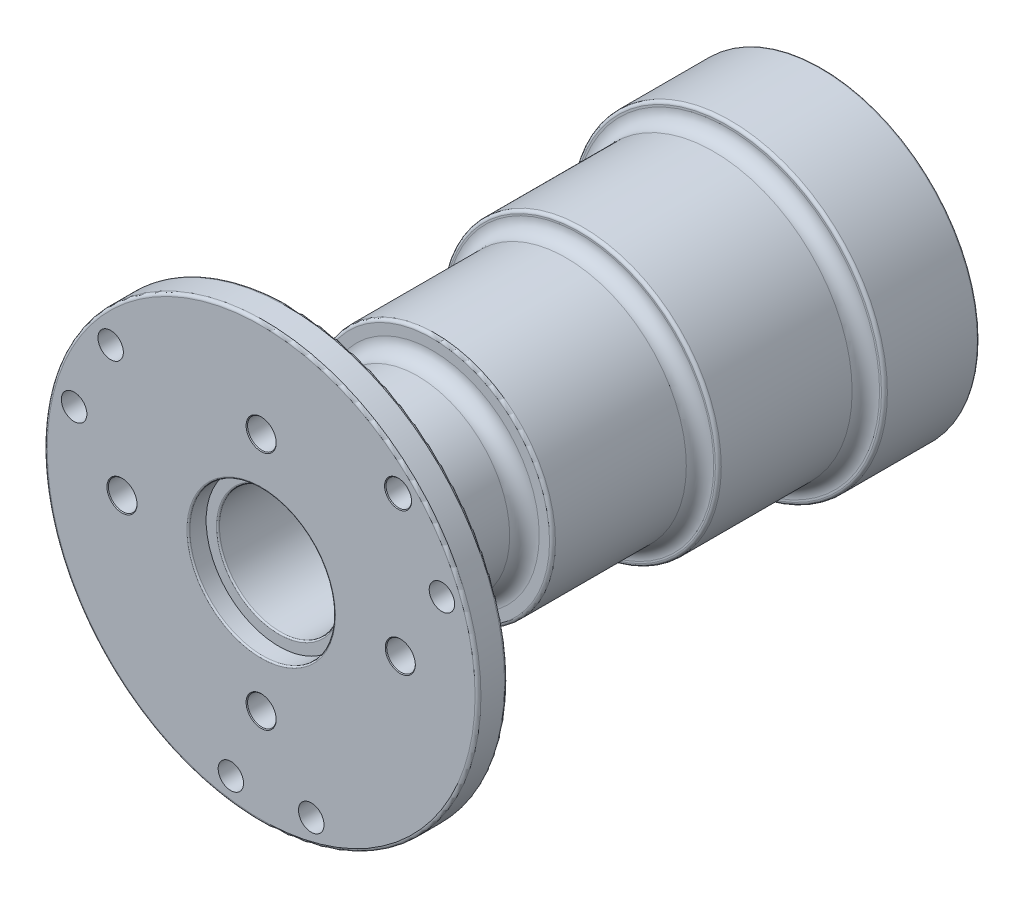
ISO-10303-21;
HEADER;
FILE_DESCRIPTION(('STEP AP214'),'2;1');
FILE_NAME('part.step','',(''),(''),'','','');
FILE_SCHEMA(('AUTOMOTIVE_DESIGN { 1 0 10303 214 1 1 1 1 }'));
ENDSEC;
DATA;
#1=APPLICATION_CONTEXT('core data for automotive mechanical design processes');
#2=APPLICATION_PROTOCOL_DEFINITION('international standard','automotive_design',2000,#1);
#3=PRODUCT_CONTEXT('',#1,'mechanical');
#4=PRODUCT('Part','Part','',(#3));
#5=PRODUCT_RELATED_PRODUCT_CATEGORY('part','',(#4));
#6=PRODUCT_DEFINITION_FORMATION('','',#4);
#7=PRODUCT_DEFINITION_CONTEXT('part definition',#1,'design');
#8=PRODUCT_DEFINITION('design','',#6,#7);
#9=PRODUCT_DEFINITION_SHAPE('','',#8);
#10=(LENGTH_UNIT() NAMED_UNIT(*) SI_UNIT(.MILLI.,.METRE.));
#11=(NAMED_UNIT(*) PLANE_ANGLE_UNIT() SI_UNIT($,.RADIAN.));
#12=(NAMED_UNIT(*) SI_UNIT($,.STERADIAN.) SOLID_ANGLE_UNIT());
#13=UNCERTAINTY_MEASURE_WITH_UNIT(LENGTH_MEASURE(1.E-05),#10,'distance_accuracy_value','');
#14=(GEOMETRIC_REPRESENTATION_CONTEXT(3) GLOBAL_UNCERTAINTY_ASSIGNED_CONTEXT((#13)) GLOBAL_UNIT_ASSIGNED_CONTEXT((#10,
#11,#12)) REPRESENTATION_CONTEXT('',''));
#15=CARTESIAN_POINT('',(0.,0.,0.));
#16=DIRECTION('',(0.,0.,1.));
#17=DIRECTION('',(1.,0.,0.));
#18=AXIS2_PLACEMENT_3D('',#15,#16,#17);
#19=CARTESIAN_POINT('',(0.,0.,67.056));
#20=DIRECTION('',(0.,0.,-1.));
#21=DIRECTION('',(-1.,0.,0.));
#22=AXIS2_PLACEMENT_3D('',#19,#20,#21);
#23=CYLINDRICAL_SURFACE('',#22,27.051);
#24=CARTESIAN_POINT('',(0.,-27.051,7.06119999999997));
#25=CARTESIAN_POINT('',(-0.0969116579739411,-27.0509992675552,7.0611957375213));
#26=CARTESIAN_POINT('',(-0.193891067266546,-27.0504736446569,7.05301614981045));
#27=CARTESIAN_POINT('',(-0.385171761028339,-27.0484273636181,7.0205037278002));
#28=CARTESIAN_POINT('',(-0.479469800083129,-27.046905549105,6.99615212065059));
#29=CARTESIAN_POINT('',(-0.662589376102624,-27.0430390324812,6.9319982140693));
#30=CARTESIAN_POINT('',(-0.751413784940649,-27.0406947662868,6.8922040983));
#31=CARTESIAN_POINT('',(-0.921099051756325,-27.0354469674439,6.79830813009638));
#32=CARTESIAN_POINT('',(-1.00196172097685,-27.0325435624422,6.74420954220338));
#33=CARTESIAN_POINT('',(-1.15357711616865,-27.0264987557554,6.6231481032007));
#34=CARTESIAN_POINT('',(-1.22431580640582,-27.0233570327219,6.55616768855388));
#35=CARTESIAN_POINT('',(-1.35355517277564,-27.0171924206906,6.41128019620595));
#36=CARTESIAN_POINT('',(-1.41205533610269,-27.0141695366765,6.33337266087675));
#37=CARTESIAN_POINT('',(-1.5152006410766,-27.0085810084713,6.16876250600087));
#38=CARTESIAN_POINT('',(-1.5598340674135,-27.0060157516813,6.08205253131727));
#39=CARTESIAN_POINT('',(-1.63390396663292,-27.0016359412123,5.90235041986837));
#40=CARTESIAN_POINT('',(-1.66334060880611,-26.9998213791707,5.80935835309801));
#41=CARTESIAN_POINT('',(-1.70614223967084,-26.9971506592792,5.61986744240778));
#42=CARTESIAN_POINT('',(-1.71952929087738,-26.9962931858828,5.52337360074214));
#43=CARTESIAN_POINT('',(-1.72991984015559,-26.9956294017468,5.32950487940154));
#44=CARTESIAN_POINT('',(-1.72692353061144,-26.9958230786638,5.23213001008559));
#45=CARTESIAN_POINT('',(-1.704650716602,-26.997238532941,5.0394137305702));
#46=CARTESIAN_POINT('',(-1.68539809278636,-26.9984588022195,4.94406954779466));
#47=CARTESIAN_POINT('',(-1.6311962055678,-27.0017875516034,4.75796895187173));
#48=CARTESIAN_POINT('',(-1.59624684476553,-27.0038960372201,4.66721256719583));
#49=CARTESIAN_POINT('',(-1.5116164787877,-27.0087653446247,4.49278712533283));
#50=CARTESIAN_POINT('',(-1.46192464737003,-27.0115266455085,4.40912333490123));
#51=CARTESIAN_POINT('',(-1.34922775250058,-27.0173899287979,4.25131557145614));
#52=CARTESIAN_POINT('',(-1.28622253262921,-27.020491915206,4.17717171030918));
#53=CARTESIAN_POINT('',(-1.14855287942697,-27.0266936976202,4.04036954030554));
#54=CARTESIAN_POINT('',(-1.07386777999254,-27.0297934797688,3.97773202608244));
#55=CARTESIAN_POINT('',(-0.915030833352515,-27.0356361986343,3.86588101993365));
#56=CARTESIAN_POINT('',(-0.830878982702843,-27.0383791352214,3.81666753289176));
#57=CARTESIAN_POINT('',(-0.655484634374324,-27.0431993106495,3.7330633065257));
#58=CARTESIAN_POINT('',(-0.564241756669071,-27.0452765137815,3.69867336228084));
#59=CARTESIAN_POINT('',(-0.377261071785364,-27.0485306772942,3.64570635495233));
#60=CARTESIAN_POINT('',(-0.281523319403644,-27.0497076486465,3.62712909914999));
#61=CARTESIAN_POINT('',(-0.0884509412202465,-27.0510273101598,3.60634059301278));
#62=CARTESIAN_POINT('',(0.00888057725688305,-27.0511718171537,3.60410059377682));
#63=CARTESIAN_POINT('',(0.202536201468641,-27.0504150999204,3.61597505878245));
#64=CARTESIAN_POINT('',(0.298860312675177,-27.0495138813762,3.6300894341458));
#65=CARTESIAN_POINT('',(0.487685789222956,-27.0467683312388,3.67424818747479));
#66=CARTESIAN_POINT('',(0.580190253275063,-27.0449247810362,3.70427936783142));
#67=CARTESIAN_POINT('',(0.758846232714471,-27.0405019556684,3.77940584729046));
#68=CARTESIAN_POINT('',(0.844997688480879,-27.0379226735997,3.82450128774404));
#69=CARTESIAN_POINT('',(1.00863373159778,-27.0323136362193,3.92854932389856));
#70=CARTESIAN_POINT('',(1.08610609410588,-27.0292832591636,3.9875211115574));
#71=CARTESIAN_POINT('',(1.23006171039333,-27.0231151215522,4.11761992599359));
#72=CARTESIAN_POINT('',(1.29654485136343,-27.0199773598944,4.18874707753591));
#73=CARTESIAN_POINT('',(1.41673226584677,-27.0139428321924,4.34126165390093));
#74=CARTESIAN_POINT('',(1.47041788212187,-27.0110464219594,4.4226637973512));
#75=CARTESIAN_POINT('',(1.56335867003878,-27.0058269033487,4.59334371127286));
#76=CARTESIAN_POINT('',(1.60261393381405,-27.0035037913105,4.68262143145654));
#77=CARTESIAN_POINT('',(1.66554742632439,-26.9996954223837,4.8664502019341));
#78=CARTESIAN_POINT('',(1.68923737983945,-26.9982095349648,4.96099722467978));
#79=CARTESIAN_POINT('',(1.72040606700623,-26.9962414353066,5.15273666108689));
#80=CARTESIAN_POINT('',(1.72788496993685,-26.995759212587,5.2499290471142));
#81=CARTESIAN_POINT('',(1.72641760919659,-26.9958530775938,5.44401476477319));
#82=CARTESIAN_POINT('',(1.71750067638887,-26.9964272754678,5.54090832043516));
#83=CARTESIAN_POINT('',(1.68355559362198,-26.9985652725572,5.73181939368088));
#84=CARTESIAN_POINT('',(1.65852741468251,-27.0001290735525,5.82583690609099));
#85=CARTESIAN_POINT('',(1.593076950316,-27.0040695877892,6.00833135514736));
#86=CARTESIAN_POINT('',(1.55265480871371,-27.0064462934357,6.09680834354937));
#87=CARTESIAN_POINT('',(1.45756783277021,-27.0117447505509,6.26572374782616));
#88=CARTESIAN_POINT('',(1.40290335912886,-27.0146664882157,6.34616236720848));
#89=CARTESIAN_POINT('',(1.28077483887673,-27.0207318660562,6.49686653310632));
#90=CARTESIAN_POINT('',(1.21328954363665,-27.0238758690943,6.5671148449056));
#91=CARTESIAN_POINT('',(1.0674644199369,-27.0300283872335,6.69531008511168));
#92=CARTESIAN_POINT('',(0.989121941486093,-27.0330368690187,6.75325400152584));
#93=CARTESIAN_POINT('',(0.823713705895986,-27.0385825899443,6.85524022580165));
#94=CARTESIAN_POINT('',(0.736636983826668,-27.0411192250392,6.89926476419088));
#95=CARTESIAN_POINT('',(0.556374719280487,-27.0454273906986,6.97201482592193));
#96=CARTESIAN_POINT('',(0.463196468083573,-27.0471998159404,7.00075824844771));
#97=CARTESIAN_POINT('',(0.307874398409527,-27.0493159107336,7.0346679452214));
#98=CARTESIAN_POINT('',(0.24673430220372,-27.0499446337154,7.04460458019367));
#99=CARTESIAN_POINT('',(0.123738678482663,-27.0507869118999,7.05787196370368));
#100=CARTESIAN_POINT('',(0.0618831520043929,-27.0510004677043,7.06120272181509));
#101=CARTESIAN_POINT('',(0.,-27.051,7.06119999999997));
#102=B_SPLINE_CURVE_WITH_KNOTS('',3,(#24,#25,#26,#27,#28,#29,#30,#31,#32,#33,#34,#35,#36,#37,
#38,#39,#40,#41,#42,#43,#44,#45,#46,#47,#48,#49,#50,#51,#52,#53,#54,#55,#56,#57,#58,#59,#60,#61,
#62,#63,#64,#65,#66,#67,#68,#69,#70,#71,#72,#73,#74,#75,#76,#77,#78,#79,#80,#81,#82,#83,#84,#85,
#86,#87,#88,#89,#90,#91,#92,#93,#94,#95,#96,#97,#98,#99,#100,#101),.UNSPECIFIED.,.T.,.F.,(4,2,2,
2,2,2,2,2,2,2,2,2,2,2,2,2,2,2,2,2,2,2,2,2,2,2,2,2,2,2,2,2,2,2,2,2,2,2,4),(0.,0.290509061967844,
0.581355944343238,0.87204890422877,1.16267557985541,1.45370135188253,1.74473931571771,
2.03602249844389,2.3273024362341,2.61818150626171,2.90905716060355,3.19950625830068,
3.48995715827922,3.78062188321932,4.07129002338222,4.3624784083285,4.6536668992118,
4.94487100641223,5.23607156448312,5.52675956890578,5.81744599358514,6.10789176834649,
6.39834026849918,6.68919286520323,6.98004844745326,7.27132550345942,7.56260069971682,
7.85365623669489,8.14470873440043,8.43524106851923,8.7257739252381,9.01630406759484,
9.30682685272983,9.59783540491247,9.88891511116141,10.1803649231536,10.4714725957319,
10.6569780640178,10.8424832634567),.UNSPECIFIED.);
#103=CARTESIAN_POINT('',(0.,-27.051,7.06119999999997));
#104=VERTEX_POINT('',#103);
#105=EDGE_CURVE('E198',#104,#104,#102,.T.);
#106=ORIENTED_EDGE('',*,*,#105,.F.);
#107=EDGE_LOOP('',(#106));
#108=FACE_BOUND('',#107,.T.);
#109=CARTESIAN_POINT('',(0.,0.,15.748));
#110=DIRECTION('',(0.,0.,1.));
#111=DIRECTION('',(1.,0.,0.));
#112=AXIS2_PLACEMENT_3D('',#109,#110,#111);
#113=CIRCLE('',#112,27.051);
#114=CARTESIAN_POINT('',(27.051,0.,15.748));
#115=VERTEX_POINT('',#114);
#116=EDGE_CURVE('E10',#115,#115,#113,.F.);
#117=ORIENTED_EDGE('',*,*,#116,.T.);
#118=EDGE_LOOP('',(#117));
#119=FACE_BOUND('',#118,.T.);
#120=CARTESIAN_POINT('',(0.,0.,0.254000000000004));
#121=DIRECTION('',(0.,0.,1.));
#122=DIRECTION('',(1.,0.,0.));
#123=AXIS2_PLACEMENT_3D('',#120,#121,#122);
#124=CIRCLE('',#123,27.051);
#125=CARTESIAN_POINT('',(27.051,0.,0.254000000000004));
#126=VERTEX_POINT('',#125);
#127=EDGE_CURVE('E132',#126,#126,#124,.T.);
#128=ORIENTED_EDGE('',*,*,#127,.T.);
#129=EDGE_LOOP('',(#128));
#130=FACE_BOUND('',#129,.T.);
#131=ADVANCED_FACE('F26',(#108,#119,#130),#23,.T.);
#132=CARTESIAN_POINT('',(0.,0.,41.656));
#133=DIRECTION('',(0.,0.,1.));
#134=DIRECTION('',(1.,0.,0.));
#135=AXIS2_PLACEMENT_3D('',#132,#133,#134);
#136=PLANE('',#135);
#137=CARTESIAN_POINT('',(0.,0.,41.656));
#138=DIRECTION('',(0.,0.,1.));
#139=DIRECTION('',(1.,0.,0.));
#140=AXIS2_PLACEMENT_3D('',#137,#138,#139);
#141=CIRCLE('',#140,23.3426);
#142=CARTESIAN_POINT('',(23.3426,0.,41.656));
#143=VERTEX_POINT('',#142);
#144=EDGE_CURVE('E40',#143,#143,#141,.T.);
#145=ORIENTED_EDGE('',*,*,#144,.T.);
#146=EDGE_LOOP('',(#145));
#147=FACE_BOUND('',#146,.T.);
#148=CARTESIAN_POINT('',(0.,0.,41.656));
#149=DIRECTION('',(0.,0.,1.));
#150=DIRECTION('',(1.,0.,0.));
#151=AXIS2_PLACEMENT_3D('',#148,#149,#150);
#152=CIRCLE('',#151,23.0632);
#153=CARTESIAN_POINT('',(23.0632,0.,41.656));
#154=VERTEX_POINT('',#153);
#155=EDGE_CURVE('E57',#154,#154,#152,.F.);
#156=ORIENTED_EDGE('',*,*,#155,.T.);
#157=EDGE_LOOP('',(#156));
#158=FACE_BOUND('',#157,.T.);
#159=ADVANCED_FACE('F232',(#147,#158),#136,.T.);
#160=CARTESIAN_POINT('',(0.,0.,67.056));
#161=DIRECTION('',(0.,0.,1.));
#162=DIRECTION('',(1.,0.,0.));
#163=AXIS2_PLACEMENT_3D('',#160,#161,#162);
#164=PLANE('',#163);
#165=CARTESIAN_POINT('',(0.,0.,67.056));
#166=DIRECTION('',(0.,0.,1.));
#167=DIRECTION('',(1.,0.,0.));
#168=AXIS2_PLACEMENT_3D('',#165,#166,#167);
#169=CIRCLE('',#168,20.193);
#170=CARTESIAN_POINT('',(20.193,0.,67.056));
#171=VERTEX_POINT('',#170);
#172=EDGE_CURVE('E48',#171,#171,#169,.T.);
#173=ORIENTED_EDGE('',*,*,#172,.T.);
#174=EDGE_LOOP('',(#173));
#175=FACE_BOUND('',#174,.T.);
#176=CARTESIAN_POINT('',(0.,0.,67.056));
#177=DIRECTION('',(0.,0.,1.));
#178=DIRECTION('',(1.,0.,0.));
#179=AXIS2_PLACEMENT_3D('',#176,#177,#178);
#180=CIRCLE('',#179,18.415);
#181=CARTESIAN_POINT('',(18.415,0.,67.056));
#182=VERTEX_POINT('',#181);
#183=EDGE_CURVE('E51',#182,#182,#180,.F.);
#184=ORIENTED_EDGE('',*,*,#183,.T.);
#185=EDGE_LOOP('',(#184));
#186=FACE_BOUND('',#185,.T.);
#187=ADVANCED_FACE('F237',(#175,#186),#164,.T.);
#188=CARTESIAN_POINT('',(0.,0.,0.));
#189=DIRECTION('',(0.,0.,1.));
#190=DIRECTION('',(1.,0.,0.));
#191=AXIS2_PLACEMENT_3D('',#188,#189,#190);
#192=PLANE('',#191);
#193=CARTESIAN_POINT('',(0.,0.,0.));
#194=DIRECTION('',(0.,0.,-1.));
#195=DIRECTION('',(-1.,0.,0.));
#196=AXIS2_PLACEMENT_3D('',#193,#194,#195);
#197=CIRCLE('',#196,22.987);
#198=CARTESIAN_POINT('',(-22.987,0.,0.));
#199=VERTEX_POINT('',#198);
#200=EDGE_CURVE('E135',#199,#199,#197,.T.);
#201=ORIENTED_EDGE('',*,*,#200,.F.);
#202=EDGE_LOOP('',(#201));
#203=FACE_BOUND('',#202,.T.);
#204=CARTESIAN_POINT('',(0.,0.,0.));
#205=DIRECTION('',(0.,0.,1.));
#206=DIRECTION('',(1.,0.,0.));
#207=AXIS2_PLACEMENT_3D('',#204,#205,#206);
#208=CIRCLE('',#207,26.797);
#209=CARTESIAN_POINT('',(26.797,0.,0.));
#210=VERTEX_POINT('',#209);
#211=EDGE_CURVE('E129',#210,#210,#208,.F.);
#212=ORIENTED_EDGE('',*,*,#211,.T.);
#213=EDGE_LOOP('',(#212));
#214=FACE_BOUND('',#213,.T.);
#215=ADVANCED_FACE('F247',(#203,#214),#192,.F.);
#216=CARTESIAN_POINT('',(0.,0.,0.254000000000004));
#217=DIRECTION('',(0.,0.,1.));
#218=DIRECTION('',(1.,0.,0.));
#219=AXIS2_PLACEMENT_3D('',#216,#217,#218);
#220=TOROIDAL_SURFACE('',#219,26.797,0.254);
#221=ORIENTED_EDGE('',*,*,#211,.F.);
#222=EDGE_LOOP('',(#221));
#223=FACE_BOUND('',#222,.T.);
#224=ORIENTED_EDGE('',*,*,#127,.F.);
#225=EDGE_LOOP('',(#224));
#226=FACE_BOUND('',#225,.T.);
#227=ADVANCED_FACE('F244',(#223,#226),#220,.T.);
#228=CARTESIAN_POINT('',(0.,0.,91.44));
#229=DIRECTION('',(0.,0.,-1.));
#230=DIRECTION('',(-1.,0.,0.));
#231=AXIS2_PLACEMENT_3D('',#228,#229,#230);
#232=CYLINDRICAL_SURFACE('',#231,15.875);
#233=CARTESIAN_POINT('',(0.,0.,69.596));
#234=DIRECTION('',(0.,0.,1.));
#235=DIRECTION('',(1.,0.,0.));
#236=AXIS2_PLACEMENT_3D('',#233,#234,#235);
#237=CIRCLE('',#236,15.875);
#238=CARTESIAN_POINT('',(-15.875,0.,69.596));
#239=VERTEX_POINT('',#238);
#240=EDGE_CURVE('E54',#239,#239,#237,.T.);
#241=CARTESIAN_POINT('',(0.,0.,90.932));
#242=DIRECTION('',(0.,0.,1.));
#243=DIRECTION('',(1.,0.,0.));
#244=AXIS2_PLACEMENT_3D('',#241,#242,#243);
#245=CIRCLE('',#244,15.875);
#246=CARTESIAN_POINT('',(-15.875,0.,90.932));
#247=VERTEX_POINT('',#246);
#248=EDGE_CURVE('E111',#247,#247,#245,.F.);
#249=CARTESIAN_POINT('',(-15.875,0.,69.596));
#250=CARTESIAN_POINT('',(-15.875,0.,69.81825));
#251=CARTESIAN_POINT('',(-15.875,0.,70.0405));
#252=CARTESIAN_POINT('',(-15.875,0.,70.485));
#253=CARTESIAN_POINT('',(-15.875,0.,70.70725));
#254=CARTESIAN_POINT('',(-15.875,0.,71.15175));
#255=CARTESIAN_POINT('',(-15.875,0.,71.374));
#256=CARTESIAN_POINT('',(-15.875,0.,71.8185));
#257=CARTESIAN_POINT('',(-15.875,0.,72.04075));
#258=CARTESIAN_POINT('',(-15.875,0.,72.48525));
#259=CARTESIAN_POINT('',(-15.875,0.,72.7075));
#260=CARTESIAN_POINT('',(-15.875,0.,73.152));
#261=CARTESIAN_POINT('',(-15.875,0.,73.37425));
#262=CARTESIAN_POINT('',(-15.875,0.,73.81875));
#263=CARTESIAN_POINT('',(-15.875,0.,74.041));
#264=CARTESIAN_POINT('',(-15.875,0.,74.4855));
#265=CARTESIAN_POINT('',(-15.875,0.,74.70775));
#266=CARTESIAN_POINT('',(-15.875,0.,75.15225));
#267=CARTESIAN_POINT('',(-15.875,0.,75.3745));
#268=CARTESIAN_POINT('',(-15.875,0.,75.819));
#269=CARTESIAN_POINT('',(-15.875,0.,76.04125));
#270=CARTESIAN_POINT('',(-15.875,0.,76.48575));
#271=CARTESIAN_POINT('',(-15.875,0.,76.708));
#272=CARTESIAN_POINT('',(-15.875,0.,77.1525));
#273=CARTESIAN_POINT('',(-15.875,0.,77.37475));
#274=CARTESIAN_POINT('',(-15.875,0.,77.81925));
#275=CARTESIAN_POINT('',(-15.875,0.,78.0415));
#276=CARTESIAN_POINT('',(-15.875,0.,78.486));
#277=CARTESIAN_POINT('',(-15.875,0.,78.70825));
#278=CARTESIAN_POINT('',(-15.875,0.,79.15275));
#279=CARTESIAN_POINT('',(-15.875,0.,79.375));
#280=CARTESIAN_POINT('',(-15.875,0.,79.8195));
#281=CARTESIAN_POINT('',(-15.875,0.,80.04175));
#282=CARTESIAN_POINT('',(-15.875,0.,80.48625));
#283=CARTESIAN_POINT('',(-15.875,0.,80.7085));
#284=CARTESIAN_POINT('',(-15.875,0.,81.153));
#285=CARTESIAN_POINT('',(-15.875,0.,81.37525));
#286=CARTESIAN_POINT('',(-15.875,0.,81.81975));
#287=CARTESIAN_POINT('',(-15.875,0.,82.042));
#288=CARTESIAN_POINT('',(-15.875,0.,82.4865));
#289=CARTESIAN_POINT('',(-15.875,0.,82.70875));
#290=CARTESIAN_POINT('',(-15.875,0.,83.15325));
#291=CARTESIAN_POINT('',(-15.875,0.,83.3755));
#292=CARTESIAN_POINT('',(-15.875,0.,83.82));
#293=CARTESIAN_POINT('',(-15.875,0.,84.04225));
#294=CARTESIAN_POINT('',(-15.875,0.,84.48675));
#295=CARTESIAN_POINT('',(-15.875,0.,84.709));
#296=CARTESIAN_POINT('',(-15.875,0.,85.1535));
#297=CARTESIAN_POINT('',(-15.875,0.,85.37575));
#298=CARTESIAN_POINT('',(-15.875,0.,85.82025));
#299=CARTESIAN_POINT('',(-15.875,0.,86.0425));
#300=CARTESIAN_POINT('',(-15.875,0.,86.487));
#301=CARTESIAN_POINT('',(-15.875,0.,86.70925));
#302=CARTESIAN_POINT('',(-15.875,0.,87.15375));
#303=CARTESIAN_POINT('',(-15.875,0.,87.376));
#304=CARTESIAN_POINT('',(-15.875,0.,87.8205));
#305=CARTESIAN_POINT('',(-15.875,0.,88.04275));
#306=CARTESIAN_POINT('',(-15.875,0.,88.48725));
#307=CARTESIAN_POINT('',(-15.875,0.,88.7095));
#308=CARTESIAN_POINT('',(-15.875,0.,89.154));
#309=CARTESIAN_POINT('',(-15.875,0.,89.37625));
#310=CARTESIAN_POINT('',(-15.875,0.,89.82075));
#311=CARTESIAN_POINT('',(-15.875,0.,90.043));
#312=CARTESIAN_POINT('',(-15.875,0.,90.4875));
#313=CARTESIAN_POINT('',(-15.875,0.,90.70975));
#314=CARTESIAN_POINT('',(-15.875,0.,90.932));
#315=B_SPLINE_CURVE_WITH_KNOTS('',3,(#249,#250,#251,#252,#253,#254,#255,#256,#257,#258,#259,
#260,#261,#262,#263,#264,#265,#266,#267,#268,#269,#270,#271,#272,#273,#274,#275,#276,#277,#278,
#279,#280,#281,#282,#283,#284,#285,#286,#287,#288,#289,#290,#291,#292,#293,#294,#295,#296,#297,
#298,#299,#300,#301,#302,#303,#304,#305,#306,#307,#308,#309,#310,#311,#312,#313,#314),
.UNSPECIFIED.,.F.,.F.,(4,2,2,2,2,2,2,2,2,2,2,2,2,2,2,2,2,2,2,2,2,2,2,2,2,2,2,2,2,2,2,2,4),(0.,
0.666749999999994,1.3335,2.00024999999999,2.667,3.33375,4.0005,4.66725,5.33399999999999,6.00075,
6.66749999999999,7.33425,8.00099999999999,8.66775,9.33449999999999,10.00125,10.668,11.33475,
12.0015,12.66825,13.335,14.00175,14.6685,15.33525,16.002,16.66875,17.3355,18.00225,18.669,
19.33575,20.0025,20.66925,21.336),.UNSPECIFIED.);
#316=EDGE_CURVE('BSEAM246',#239,#247,#315,.T.);
#317=ORIENTED_EDGE('',*,*,#240,.T.);
#318=ORIENTED_EDGE('',*,*,#248,.T.);
#319=ORIENTED_EDGE('',*,*,#316,.T.);
#320=ORIENTED_EDGE('',*,*,#316,.F.);
#321=EDGE_LOOP('',(#317,#319,#318,#320));
#322=FACE_BOUND('',#321,.T.);
#323=ADVANCED_FACE('F246',(#322),#232,.T.);
#324=CARTESIAN_POINT('',(0.,0.,91.44));
#325=DIRECTION('',(0.,0.,1.));
#326=DIRECTION('',(1.,0.,0.));
#327=AXIS2_PLACEMENT_3D('',#324,#325,#326);
#328=PLANE('',#327);
#329=CARTESIAN_POINT('',(31.1239869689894,11.947379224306,91.44));
#330=DIRECTION('',(0.,0.,1.));
#331=DIRECTION('',(1.,0.,0.));
#332=AXIS2_PLACEMENT_3D('',#329,#330,#331);
#333=CIRCLE('',#332,2.1844);
#334=CARTESIAN_POINT('',(33.3083869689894,11.947379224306,91.44));
#335=VERTEX_POINT('',#334);
#336=EDGE_CURVE('E476',#335,#335,#333,.T.);
#337=ORIENTED_EDGE('',*,*,#336,.T.);
#338=EDGE_LOOP('',(#337));
#339=FACE_BOUND('',#338,.T.);
#340=CARTESIAN_POINT('',(-25.9087274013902,20.9804737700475,91.44));
#341=DIRECTION('',(0.,0.,1.));
#342=DIRECTION('',(1.,0.,0.));
#343=AXIS2_PLACEMENT_3D('',#340,#341,#342);
#344=CIRCLE('',#343,2.1844);
#345=CARTESIAN_POINT('',(-23.7243274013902,20.9804737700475,91.44));
#346=VERTEX_POINT('',#345);
#347=EDGE_CURVE('E468',#346,#346,#344,.T.);
#348=ORIENTED_EDGE('',*,*,#347,.T.);
#349=EDGE_LOOP('',(#348));
#350=FACE_BOUND('',#349,.T.);
#351=CARTESIAN_POINT('',(-5.21525956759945,-32.9278529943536,91.44));
#352=DIRECTION('',(0.,0.,1.));
#353=DIRECTION('',(1.,0.,0.));
#354=AXIS2_PLACEMENT_3D('',#351,#352,#353);
#355=CIRCLE('',#354,2.1844);
#356=CARTESIAN_POINT('',(-3.03085956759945,-32.9278529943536,91.44));
#357=VERTEX_POINT('',#356);
#358=EDGE_CURVE('E462',#357,#357,#355,.T.);
#359=ORIENTED_EDGE('',*,*,#358,.T.);
#360=EDGE_LOOP('',(#359));
#361=FACE_BOUND('',#360,.T.);
#362=CARTESIAN_POINT('',(-32.2023277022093,8.62858770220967,91.44));
#363=DIRECTION('',(0.,0.,1.));
#364=DIRECTION('',(1.,0.,0.));
#365=AXIS2_PLACEMENT_3D('',#362,#363,#364);
#366=CIRCLE('',#365,2.19710000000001);
#367=CARTESIAN_POINT('',(-30.0052277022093,8.62858770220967,91.44));
#368=VERTEX_POINT('',#367);
#369=EDGE_CURVE('E192',#368,#368,#366,.T.);
#370=ORIENTED_EDGE('',*,*,#369,.T.);
#371=EDGE_LOOP('',(#370));
#372=FACE_BOUND('',#371,.T.);
#373=CARTESIAN_POINT('',(8.62858770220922,-32.2023277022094,91.44));
#374=DIRECTION('',(0.,0.,1.));
#375=DIRECTION('',(1.,0.,0.));
#376=AXIS2_PLACEMENT_3D('',#373,#374,#375);
#377=CIRCLE('',#376,2.19710000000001);
#378=CARTESIAN_POINT('',(10.8256877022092,-32.2023277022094,91.44));
#379=VERTEX_POINT('',#378);
#380=EDGE_CURVE('E186',#379,#379,#377,.T.);
#381=ORIENTED_EDGE('',*,*,#380,.T.);
#382=EDGE_LOOP('',(#381));
#383=FACE_BOUND('',#382,.T.);
#384=CARTESIAN_POINT('',(23.57374,23.57374,91.44));
#385=DIRECTION('',(0.,0.,1.));
#386=DIRECTION('',(1.,0.,0.));
#387=AXIS2_PLACEMENT_3D('',#384,#385,#386);
#388=CIRCLE('',#387,2.19710000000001);
#389=CARTESIAN_POINT('',(25.77084,23.57374,91.44));
#390=VERTEX_POINT('',#389);
#391=EDGE_CURVE('E183',#390,#390,#388,.T.);
#392=ORIENTED_EDGE('',*,*,#391,.T.);
#393=EDGE_LOOP('',(#392));
#394=FACE_BOUND('',#393,.T.);
#395=CARTESIAN_POINT('',(0.,-20.6375,91.44));
#396=DIRECTION('',(0.,0.,1.));
#397=DIRECTION('',(1.,0.,0.));
#398=AXIS2_PLACEMENT_3D('',#395,#396,#397);
#399=CIRCLE('',#398,2.46380000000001);
#400=CARTESIAN_POINT('',(2.46380000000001,-20.6375,91.44));
#401=VERTEX_POINT('',#400);
#402=EDGE_CURVE('E180',#401,#401,#399,.T.);
#403=ORIENTED_EDGE('',*,*,#402,.T.);
#404=EDGE_LOOP('',(#403));
#405=FACE_BOUND('',#404,.T.);
#406=CARTESIAN_POINT('',(0.,20.6375,91.44));
#407=DIRECTION('',(0.,0.,1.));
#408=DIRECTION('',(1.,0.,0.));
#409=AXIS2_PLACEMENT_3D('',#406,#407,#408);
#410=CIRCLE('',#409,2.46380000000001);
#411=CARTESIAN_POINT('',(2.46380000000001,20.6375,91.44));
#412=VERTEX_POINT('',#411);
#413=EDGE_CURVE('E177',#412,#412,#410,.T.);
#414=ORIENTED_EDGE('',*,*,#413,.T.);
#415=EDGE_LOOP('',(#414));
#416=FACE_BOUND('',#415,.T.);
#417=CARTESIAN_POINT('',(23.9560673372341,-0.48588230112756,91.44));
#418=DIRECTION('',(0.,0.,1.));
#419=DIRECTION('',(1.,0.,0.));
#420=AXIS2_PLACEMENT_3D('',#417,#418,#419);
#421=CIRCLE('',#420,2.46380000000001);
#422=CARTESIAN_POINT('',(26.4198673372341,-0.48588230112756,91.44));
#423=VERTEX_POINT('',#422);
#424=EDGE_CURVE('E174',#423,#423,#421,.T.);
#425=ORIENTED_EDGE('',*,*,#424,.T.);
#426=EDGE_LOOP('',(#425));
#427=FACE_BOUND('',#426,.T.);
#428=CARTESIAN_POINT('',(-23.9560673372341,-0.48588230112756,91.44));
#429=DIRECTION('',(0.,0.,1.));
#430=DIRECTION('',(1.,0.,0.));
#431=AXIS2_PLACEMENT_3D('',#428,#429,#430);
#432=CIRCLE('',#431,2.46380000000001);
#433=CARTESIAN_POINT('',(-21.4922673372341,-0.48588230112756,91.44));
#434=VERTEX_POINT('',#433);
#435=EDGE_CURVE('E171',#434,#434,#432,.T.);
#436=ORIENTED_EDGE('',*,*,#435,.T.);
#437=EDGE_LOOP('',(#436));
#438=FACE_BOUND('',#437,.T.);
#439=CARTESIAN_POINT('',(0.,0.,91.44));
#440=DIRECTION('',(0.,0.,1.));
#441=DIRECTION('',(1.,0.,0.));
#442=AXIS2_PLACEMENT_3D('',#439,#440,#441);
#443=CIRCLE('',#442,16.383);
#444=CARTESIAN_POINT('',(16.383,0.,91.44));
#445=VERTEX_POINT('',#444);
#446=EDGE_CURVE('E114',#445,#445,#443,.T.);
#447=ORIENTED_EDGE('',*,*,#446,.T.);
#448=EDGE_LOOP('',(#447));
#449=FACE_BOUND('',#448,.T.);
#450=CARTESIAN_POINT('',(0.,0.,91.44));
#451=DIRECTION('',(0.,0.,1.));
#452=DIRECTION('',(1.,0.,0.));
#453=AXIS2_PLACEMENT_3D('',#450,#451,#452);
#454=CIRCLE('',#453,36.83);
#455=CARTESIAN_POINT('',(36.83,0.,91.44));
#456=VERTEX_POINT('',#455);
#457=EDGE_CURVE('E117',#456,#456,#454,.F.);
#458=ORIENTED_EDGE('',*,*,#457,.T.);
#459=EDGE_LOOP('',(#458));
#460=FACE_BOUND('',#459,.T.);
#461=ADVANCED_FACE('F254',(#339,#350,#361,#372,#383,#394,#405,#416,#427,#438,#449,#460),#328,.F.);
#462=CARTESIAN_POINT('',(0.,0.,96.52));
#463=DIRECTION('',(0.,0.,-1.));
#464=DIRECTION('',(-1.,0.,0.));
#465=AXIS2_PLACEMENT_3D('',#462,#463,#464);
#466=CYLINDRICAL_SURFACE('',#465,37.338);
#467=CARTESIAN_POINT('',(0.,0.,91.948));
#468=DIRECTION('',(0.,0.,1.));
#469=DIRECTION('',(1.,0.,0.));
#470=AXIS2_PLACEMENT_3D('',#467,#468,#469);
#471=CIRCLE('',#470,37.338);
#472=CARTESIAN_POINT('',(37.338,0.,91.948));
#473=VERTEX_POINT('',#472);
#474=EDGE_CURVE('E120',#473,#473,#471,.T.);
#475=ORIENTED_EDGE('',*,*,#474,.T.);
#476=EDGE_LOOP('',(#475));
#477=FACE_BOUND('',#476,.T.);
#478=CARTESIAN_POINT('',(0.,0.,96.012));
#479=DIRECTION('',(0.,0.,1.));
#480=DIRECTION('',(1.,0.,0.));
#481=AXIS2_PLACEMENT_3D('',#478,#479,#480);
#482=CIRCLE('',#481,37.338);
#483=CARTESIAN_POINT('',(37.338,0.,96.012));
#484=VERTEX_POINT('',#483);
#485=EDGE_CURVE('E123',#484,#484,#482,.F.);
#486=ORIENTED_EDGE('',*,*,#485,.T.);
#487=EDGE_LOOP('',(#486));
#488=FACE_BOUND('',#487,.T.);
#489=ADVANCED_FACE('F289',(#477,#488),#466,.T.);
#490=CARTESIAN_POINT('',(0.,0.,96.52));
#491=DIRECTION('',(0.,0.,1.));
#492=DIRECTION('',(1.,0.,0.));
#493=AXIS2_PLACEMENT_3D('',#490,#491,#492);
#494=PLANE('',#493);
#495=CARTESIAN_POINT('',(31.1239869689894,11.947379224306,96.52));
#496=DIRECTION('',(0.,0.,1.));
#497=DIRECTION('',(1.,0.,0.));
#498=AXIS2_PLACEMENT_3D('',#495,#496,#497);
#499=CIRCLE('',#498,2.1844);
#500=CARTESIAN_POINT('',(33.3083869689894,11.947379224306,96.52));
#501=VERTEX_POINT('',#500);
#502=EDGE_CURVE('E479',#501,#501,#499,.T.);
#503=ORIENTED_EDGE('',*,*,#502,.F.);
#504=EDGE_LOOP('',(#503));
#505=FACE_BOUND('',#504,.T.);
#506=CARTESIAN_POINT('',(-25.9087274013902,20.9804737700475,96.52));
#507=DIRECTION('',(0.,0.,1.));
#508=DIRECTION('',(1.,0.,0.));
#509=AXIS2_PLACEMENT_3D('',#506,#507,#508);
#510=CIRCLE('',#509,2.1844);
#511=CARTESIAN_POINT('',(-23.7243274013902,20.9804737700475,96.52));
#512=VERTEX_POINT('',#511);
#513=EDGE_CURVE('E473',#512,#512,#510,.T.);
#514=ORIENTED_EDGE('',*,*,#513,.F.);
#515=EDGE_LOOP('',(#514));
#516=FACE_BOUND('',#515,.T.);
#517=CARTESIAN_POINT('',(-5.21525956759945,-32.9278529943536,96.52));
#518=DIRECTION('',(0.,0.,1.));
#519=DIRECTION('',(1.,0.,0.));
#520=AXIS2_PLACEMENT_3D('',#517,#518,#519);
#521=CIRCLE('',#520,2.1844);
#522=CARTESIAN_POINT('',(-3.03085956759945,-32.9278529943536,96.52));
#523=VERTEX_POINT('',#522);
#524=EDGE_CURVE('E464',#523,#523,#521,.T.);
#525=ORIENTED_EDGE('',*,*,#524,.F.);
#526=EDGE_LOOP('',(#525));
#527=FACE_BOUND('',#526,.T.);
#528=CARTESIAN_POINT('',(-32.2023277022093,8.62858770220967,96.52));
#529=DIRECTION('',(0.,0.,1.));
#530=DIRECTION('',(1.,0.,0.));
#531=AXIS2_PLACEMENT_3D('',#528,#529,#530);
#532=CIRCLE('',#531,2.19710000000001);
#533=CARTESIAN_POINT('',(-30.0052277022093,8.62858770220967,96.52));
#534=VERTEX_POINT('',#533);
#535=EDGE_CURVE('E195',#534,#534,#532,.T.);
#536=ORIENTED_EDGE('',*,*,#535,.F.);
#537=EDGE_LOOP('',(#536));
#538=FACE_BOUND('',#537,.T.);
#539=CARTESIAN_POINT('',(8.62858770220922,-32.2023277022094,96.52));
#540=DIRECTION('',(0.,0.,1.));
#541=DIRECTION('',(1.,0.,0.));
#542=AXIS2_PLACEMENT_3D('',#539,#540,#541);
#543=CIRCLE('',#542,2.19710000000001);
#544=CARTESIAN_POINT('',(10.8256877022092,-32.2023277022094,96.52));
#545=VERTEX_POINT('',#544);
#546=EDGE_CURVE('E189',#545,#545,#543,.T.);
#547=ORIENTED_EDGE('',*,*,#546,.F.);
#548=EDGE_LOOP('',(#547));
#549=FACE_BOUND('',#548,.T.);
#550=CARTESIAN_POINT('',(23.57374,23.57374,96.52));
#551=DIRECTION('',(0.,0.,1.));
#552=DIRECTION('',(1.,0.,0.));
#553=AXIS2_PLACEMENT_3D('',#550,#551,#552);
#554=CIRCLE('',#553,2.32410000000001);
#555=CARTESIAN_POINT('',(25.89784,23.57374,96.52));
#556=VERTEX_POINT('',#555);
#557=EDGE_CURVE('E69',#556,#556,#554,.F.);
#558=ORIENTED_EDGE('',*,*,#557,.T.);
#559=EDGE_LOOP('',(#558));
#560=FACE_BOUND('',#559,.T.);
#561=CARTESIAN_POINT('',(0.,-20.6375,96.52));
#562=DIRECTION('',(0.,0.,1.));
#563=DIRECTION('',(1.,0.,0.));
#564=AXIS2_PLACEMENT_3D('',#561,#562,#563);
#565=CIRCLE('',#564,2.59080000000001);
#566=CARTESIAN_POINT('',(2.59080000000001,-20.6375,96.52));
#567=VERTEX_POINT('',#566);
#568=EDGE_CURVE('E75',#567,#567,#565,.F.);
#569=ORIENTED_EDGE('',*,*,#568,.T.);
#570=EDGE_LOOP('',(#569));
#571=FACE_BOUND('',#570,.T.);
#572=CARTESIAN_POINT('',(23.9560673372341,-0.48588230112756,96.52));
#573=DIRECTION('',(0.,0.,1.));
#574=DIRECTION('',(1.,0.,0.));
#575=AXIS2_PLACEMENT_3D('',#572,#573,#574);
#576=CIRCLE('',#575,2.59080000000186);
#577=CARTESIAN_POINT('',(26.5468673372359,-0.48588230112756,96.52));
#578=VERTEX_POINT('',#577);
#579=EDGE_CURVE('E81',#578,#578,#576,.F.);
#580=ORIENTED_EDGE('',*,*,#579,.T.);
#581=EDGE_LOOP('',(#580));
#582=FACE_BOUND('',#581,.T.);
#583=CARTESIAN_POINT('',(0.,20.6375,96.52));
#584=DIRECTION('',(0.,0.,1.));
#585=DIRECTION('',(1.,0.,0.));
#586=AXIS2_PLACEMENT_3D('',#583,#584,#585);
#587=CIRCLE('',#586,2.59080000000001);
#588=CARTESIAN_POINT('',(2.59080000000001,20.6375,96.52));
#589=VERTEX_POINT('',#588);
#590=EDGE_CURVE('E87',#589,#589,#587,.F.);
#591=ORIENTED_EDGE('',*,*,#590,.T.);
#592=EDGE_LOOP('',(#591));
#593=FACE_BOUND('',#592,.T.);
#594=CARTESIAN_POINT('',(-23.9560673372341,-0.48588230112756,96.52));
#595=DIRECTION('',(0.,0.,1.));
#596=DIRECTION('',(1.,0.,0.));
#597=AXIS2_PLACEMENT_3D('',#594,#595,#596);
#598=CIRCLE('',#597,2.59080000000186);
#599=CARTESIAN_POINT('',(-21.3652673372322,-0.48588230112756,96.52));
#600=VERTEX_POINT('',#599);
#601=EDGE_CURVE('E93',#600,#600,#598,.F.);
#602=ORIENTED_EDGE('',*,*,#601,.T.);
#603=EDGE_LOOP('',(#602));
#604=FACE_BOUND('',#603,.T.);
#605=CARTESIAN_POINT('',(0.,0.,96.52));
#606=DIRECTION('',(0.,0.,1.));
#607=DIRECTION('',(1.,0.,0.));
#608=AXIS2_PLACEMENT_3D('',#605,#606,#607);
#609=CIRCLE('',#608,12.7762);
#610=CARTESIAN_POINT('',(12.7762,0.,96.52));
#611=VERTEX_POINT('',#610);
#612=EDGE_CURVE('E105',#611,#611,#609,.F.);
#613=ORIENTED_EDGE('',*,*,#612,.T.);
#614=EDGE_LOOP('',(#613));
#615=FACE_BOUND('',#614,.T.);
#616=CARTESIAN_POINT('',(0.,0.,96.52));
#617=DIRECTION('',(0.,0.,1.));
#618=DIRECTION('',(1.,0.,0.));
#619=AXIS2_PLACEMENT_3D('',#616,#617,#618);
#620=CIRCLE('',#619,36.83);
#621=CARTESIAN_POINT('',(36.83,0.,96.52));
#622=VERTEX_POINT('',#621);
#623=EDGE_CURVE('E126',#622,#622,#620,.T.);
#624=ORIENTED_EDGE('',*,*,#623,.T.);
#625=EDGE_LOOP('',(#624));
#626=FACE_BOUND('',#625,.T.);
#627=ADVANCED_FACE('F302',(#505,#516,#527,#538,#549,#560,#571,#582,#593,#604,#615,#626),#494,.T.);
#628=CARTESIAN_POINT('',(0.,0.,10.8712));
#629=DIRECTION('',(0.,0.,-1.));
#630=DIRECTION('',(-1.,0.,0.));
#631=AXIS2_PLACEMENT_3D('',#628,#629,#630);
#632=CYLINDRICAL_SURFACE('',#631,22.987);
#633=CARTESIAN_POINT('',(0.,-22.987,7.06119999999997));
#634=CARTESIAN_POINT('',(0.0968709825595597,-22.9869991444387,7.06119575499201));
#635=CARTESIAN_POINT('',(0.193808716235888,-22.9863811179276,7.05302300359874));
#636=CARTESIAN_POINT('',(0.385004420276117,-22.983975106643,7.02053932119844));
#637=CARTESIAN_POINT('',(0.479259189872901,-22.9821857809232,6.99620989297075));
#638=CARTESIAN_POINT('',(0.662292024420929,-22.9776394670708,6.9321183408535));
#639=CARTESIAN_POINT('',(0.751073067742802,-22.9748830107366,6.89236469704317));
#640=CARTESIAN_POINT('',(0.920680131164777,-22.9687119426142,6.79856775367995));
#641=CARTESIAN_POINT('',(1.00150789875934,-22.9652974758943,6.7445276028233));
#642=CARTESIAN_POINT('',(1.15310583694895,-22.9581857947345,6.62356851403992));
#643=CARTESIAN_POINT('',(1.22385703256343,-22.9544880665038,6.55662582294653));
#644=CARTESIAN_POINT('',(1.35313083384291,-22.9472309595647,6.41181172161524));
#645=CARTESIAN_POINT('',(1.41165291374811,-22.9436715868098,6.33393984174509));
#646=CARTESIAN_POINT('',(1.51486958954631,-22.9370884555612,6.16936542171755));
#647=CARTESIAN_POINT('',(1.55954781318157,-22.9340653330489,6.08265258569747));
#648=CARTESIAN_POINT('',(1.63370389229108,-22.9289025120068,5.90292963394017));
#649=CARTESIAN_POINT('',(1.66318197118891,-22.926762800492,5.80991961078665));
#650=CARTESIAN_POINT('',(1.7060467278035,-22.9236131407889,5.62043028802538));
#651=CARTESIAN_POINT('',(1.71946393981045,-22.9226010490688,5.52395793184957));
#652=CARTESIAN_POINT('',(1.72992039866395,-22.9218143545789,5.33012550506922));
#653=CARTESIAN_POINT('',(1.72695990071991,-22.9220397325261,5.23276544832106));
#654=CARTESIAN_POINT('',(1.70477025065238,-22.9237005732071,5.04013005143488));
#655=CARTESIAN_POINT('',(1.68557422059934,-22.9251335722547,4.94485087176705));
#656=CARTESIAN_POINT('',(1.63150983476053,-22.9290443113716,4.75887078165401));
#657=CARTESIAN_POINT('',(1.59664135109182,-22.931522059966,4.66816990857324));
#658=CARTESIAN_POINT('',(1.51218453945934,-22.937245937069,4.49381516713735));
#659=CARTESIAN_POINT('',(1.46258128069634,-22.9404928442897,4.41016855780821));
#660=CARTESIAN_POINT('',(1.35007375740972,-22.9473884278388,4.25237613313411));
#661=CARTESIAN_POINT('',(1.28716927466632,-22.9510371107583,4.17823047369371));
#662=CARTESIAN_POINT('',(1.14965882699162,-22.9583360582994,4.04135203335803));
#663=CARTESIAN_POINT('',(1.07502421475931,-22.9619863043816,3.9786480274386));
#664=CARTESIAN_POINT('',(0.916272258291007,-22.9688684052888,3.86665508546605));
#665=CARTESIAN_POINT('',(0.832154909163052,-22.9721002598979,3.81736615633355));
#666=CARTESIAN_POINT('',(0.656807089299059,-22.9777818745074,3.73360456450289));
#667=CARTESIAN_POINT('',(0.565576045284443,-22.980231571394,3.69913309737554));
#668=CARTESIAN_POINT('',(0.378598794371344,-22.9840720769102,3.64600469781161));
#669=CARTESIAN_POINT('',(0.282852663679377,-22.9854629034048,3.62734749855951));
#670=CARTESIAN_POINT('',(0.089812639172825,-22.9870266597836,3.60641314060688));
#671=CARTESIAN_POINT('',(-0.00747691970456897,-22.9872025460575,3.60409621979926));
#672=CARTESIAN_POINT('',(-0.201061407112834,-22.9863244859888,3.61580414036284));
#673=CARTESIAN_POINT('',(-0.297356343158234,-22.9852705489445,3.62982885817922));
#674=CARTESIAN_POINT('',(-0.486105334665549,-22.9820533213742,3.67378900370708));
#675=CARTESIAN_POINT('',(-0.578563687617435,-22.9798913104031,3.70370608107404));
#676=CARTESIAN_POINT('',(-0.757147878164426,-22.9747009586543,3.77858301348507));
#677=CARTESIAN_POINT('',(-0.843273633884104,-22.971672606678,3.82354306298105));
#678=CARTESIAN_POINT('',(-1.00692927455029,-22.9650820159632,3.92733016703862));
#679=CARTESIAN_POINT('',(-1.08444235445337,-22.9615187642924,3.98618365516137));
#680=CARTESIAN_POINT('',(-1.22850289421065,-22.9542624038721,4.11604869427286));
#681=CARTESIAN_POINT('',(-1.29505019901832,-22.9505692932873,4.18706041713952));
#682=CARTESIAN_POINT('',(-1.41542582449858,-22.9434607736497,4.33939828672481));
#683=CARTESIAN_POINT('',(-1.46922826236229,-22.9400459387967,4.42074491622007));
#684=CARTESIAN_POINT('',(-1.56240961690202,-22.933888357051,4.59134109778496));
#685=CARTESIAN_POINT('',(-1.60178865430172,-22.9311456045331,4.68059058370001));
#686=CARTESIAN_POINT('',(-1.66496097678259,-22.9266456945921,4.86436613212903));
#687=CARTESIAN_POINT('',(-1.68877029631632,-22.9248875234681,4.95888665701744));
#688=CARTESIAN_POINT('',(-1.7201795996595,-22.9225522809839,5.15059748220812));
#689=CARTESIAN_POINT('',(-1.72777983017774,-22.9219751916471,5.24778774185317));
#690=CARTESIAN_POINT('',(-1.72655258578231,-22.9220676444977,5.44182190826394));
#691=CARTESIAN_POINT('',(-1.71776578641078,-22.9227340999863,5.53866607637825));
#692=CARTESIAN_POINT('',(-1.68409851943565,-22.9252319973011,5.72949940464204));
#693=CARTESIAN_POINT('',(-1.65921802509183,-22.9270634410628,5.82348856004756));
#694=CARTESIAN_POINT('',(-1.5940794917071,-22.9316841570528,6.00594788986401));
#695=CARTESIAN_POINT('',(-1.55382196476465,-22.9344733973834,6.09441824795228));
#696=CARTESIAN_POINT('',(-1.45907699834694,-22.9406954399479,6.2633507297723));
#697=CARTESIAN_POINT('',(-1.40458984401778,-22.9441282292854,6.34381301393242));
#698=CARTESIAN_POINT('',(-1.28278001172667,-22.9512606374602,6.49465298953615));
#699=CARTESIAN_POINT('',(-1.21542741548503,-22.9549608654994,6.56500649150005));
#700=CARTESIAN_POINT('',(-1.06984877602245,-22.9622057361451,6.69343595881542));
#701=CARTESIAN_POINT('',(-0.991620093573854,-22.9657503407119,6.75150893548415));
#702=CARTESIAN_POINT('',(-0.826385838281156,-22.9722897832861,6.85379149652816));
#703=CARTESIAN_POINT('',(-0.739366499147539,-22.9752837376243,6.89797887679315));
#704=CARTESIAN_POINT('',(-0.559182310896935,-22.980373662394,6.97106007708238));
#705=CARTESIAN_POINT('',(-0.466024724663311,-22.9824706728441,6.99997161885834));
#706=CARTESIAN_POINT('',(-0.310257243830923,-22.9849872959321,7.03425245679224));
#707=CARTESIAN_POINT('',(-0.248651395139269,-22.9857386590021,7.04434451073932));
#708=CARTESIAN_POINT('',(-0.124706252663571,-22.9867452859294,7.05781964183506));
#709=CARTESIAN_POINT('',(-0.0623669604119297,-22.9870005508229,7.06120273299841));
#710=CARTESIAN_POINT('',(0.,-22.987,7.06119999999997));
#711=B_SPLINE_CURVE_WITH_KNOTS('',3,(#633,#634,#635,#636,#637,#638,#639,#640,#641,#642,#643,
#644,#645,#646,#647,#648,#649,#650,#651,#652,#653,#654,#655,#656,#657,#658,#659,#660,#661,#662,
#663,#664,#665,#666,#667,#668,#669,#670,#671,#672,#673,#674,#675,#676,#677,#678,#679,#680,#681,
#682,#683,#684,#685,#686,#687,#688,#689,#690,#691,#692,#693,#694,#695,#696,#697,#698,#699,#700,
#701,#702,#703,#704,#705,#706,#707,#708,#709,#710),.UNSPECIFIED.,.T.,.F.,(4,2,2,2,2,2,2,2,2,2,2,
2,2,2,2,2,2,2,2,2,2,2,2,2,2,2,2,2,2,2,2,2,2,2,2,2,2,2,4),(0.,0.290385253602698,
0.581103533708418,0.871662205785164,1.16215689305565,1.45319157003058,1.74423875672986,
2.03562884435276,2.32701464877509,2.61784559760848,2.90867201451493,3.19890654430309,
3.48914344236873,3.77967544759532,4.07021221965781,4.36146989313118,4.65272771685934,
4.94400903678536,5.23528544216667,5.52585281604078,5.81641799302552,6.10664839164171,
6.39688254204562,6.68767340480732,6.9784683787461,7.26984894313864,7.56122706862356,
7.85230464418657,8.14337778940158,8.43372940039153,8.7240814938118,9.0144239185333,
9.30476052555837,9.59578070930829,9.88687163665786,10.1784256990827,10.4696407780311,
10.6565954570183,10.843549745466),.UNSPECIFIED.);
#712=CARTESIAN_POINT('',(0.,-22.987,7.06119999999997));
#713=VERTEX_POINT('',#712);
#714=EDGE_CURVE('E205',#713,#713,#711,.T.);
#715=ORIENTED_EDGE('',*,*,#714,.F.);
#716=EDGE_LOOP('',(#715));
#717=FACE_BOUND('',#716,.T.);
#718=CARTESIAN_POINT('',(0.,0.,10.8712));
#719=DIRECTION('',(0.,0.,-1.));
#720=DIRECTION('',(-1.,0.,0.));
#721=AXIS2_PLACEMENT_3D('',#718,#719,#720);
#722=CIRCLE('',#721,22.987);
#723=CARTESIAN_POINT('',(-22.987,0.,10.8712));
#724=VERTEX_POINT('',#723);
#725=EDGE_CURVE('E138',#724,#724,#722,.F.);
#726=ORIENTED_EDGE('',*,*,#725,.T.);
#727=EDGE_LOOP('',(#726));
#728=FACE_BOUND('',#727,.T.);
#729=ORIENTED_EDGE('',*,*,#200,.T.);
#730=EDGE_LOOP('',(#729));
#731=FACE_BOUND('',#730,.T.);
#732=ADVANCED_FACE('F312',(#717,#728,#731),#632,.F.);
#733=CARTESIAN_POINT('',(0.,0.,10.8712));
#734=DIRECTION('',(0.,0.,-1.));
#735=DIRECTION('',(-1.,0.,0.));
#736=AXIS2_PLACEMENT_3D('',#733,#734,#735);
#737=PLANE('',#736);
#738=CARTESIAN_POINT('',(0.,0.,10.8712));
#739=DIRECTION('',(0.,0.,-1.));
#740=DIRECTION('',(-1.,0.,0.));
#741=AXIS2_PLACEMENT_3D('',#738,#739,#740);
#742=CIRCLE('',#741,23.876);
#743=CARTESIAN_POINT('',(-23.876,0.,10.8712));
#744=VERTEX_POINT('',#743);
#745=EDGE_CURVE('E144',#744,#744,#742,.T.);
#746=ORIENTED_EDGE('',*,*,#745,.F.);
#747=EDGE_LOOP('',(#746));
#748=FACE_BOUND('',#747,.T.);
#749=ORIENTED_EDGE('',*,*,#725,.F.);
#750=EDGE_LOOP('',(#749));
#751=FACE_BOUND('',#750,.T.);
#752=ADVANCED_FACE('F318',(#748,#751),#737,.F.);
#753=CARTESIAN_POINT('',(0.,0.,12.4714));
#754=DIRECTION('',(0.,0.,-1.));
#755=DIRECTION('',(-1.,0.,0.));
#756=AXIS2_PLACEMENT_3D('',#753,#754,#755);
#757=CYLINDRICAL_SURFACE('',#756,23.876);
#758=CARTESIAN_POINT('',(0.,0.,12.4714));
#759=DIRECTION('',(0.,0.,-1.));
#760=DIRECTION('',(-1.,0.,0.));
#761=AXIS2_PLACEMENT_3D('',#758,#759,#760);
#762=CIRCLE('',#761,23.876);
#763=CARTESIAN_POINT('',(-23.876,0.,12.4714));
#764=VERTEX_POINT('',#763);
#765=EDGE_CURVE('E141',#764,#764,#762,.T.);
#766=ORIENTED_EDGE('',*,*,#765,.F.);
#767=EDGE_LOOP('',(#766));
#768=FACE_BOUND('',#767,.T.);
#769=ORIENTED_EDGE('',*,*,#745,.T.);
#770=EDGE_LOOP('',(#769));
#771=FACE_BOUND('',#770,.T.);
#772=ADVANCED_FACE('F324',(#768,#771),#757,.F.);
#773=CARTESIAN_POINT('',(0.,0.,12.4714));
#774=DIRECTION('',(0.,0.,-1.));
#775=DIRECTION('',(-1.,0.,0.));
#776=AXIS2_PLACEMENT_3D('',#773,#774,#775);
#777=PLANE('',#776);
#778=CARTESIAN_POINT('',(0.,0.,12.4714));
#779=DIRECTION('',(0.,0.,-1.));
#780=DIRECTION('',(-1.,0.,0.));
#781=AXIS2_PLACEMENT_3D('',#778,#779,#780);
#782=CIRCLE('',#781,20.6375);
#783=CARTESIAN_POINT('',(-20.6375,0.,12.4714));
#784=VERTEX_POINT('',#783);
#785=EDGE_CURVE('E150',#784,#784,#782,.T.);
#786=ORIENTED_EDGE('',*,*,#785,.F.);
#787=EDGE_LOOP('',(#786));
#788=FACE_BOUND('',#787,.T.);
#789=ORIENTED_EDGE('',*,*,#765,.T.);
#790=EDGE_LOOP('',(#789));
#791=FACE_BOUND('',#790,.T.);
#792=ADVANCED_FACE('F327',(#788,#791),#777,.T.);
#793=CARTESIAN_POINT('',(0.,0.,14.0716));
#794=DIRECTION('',(0.,0.,-1.));
#795=DIRECTION('',(-1.,0.,0.));
#796=AXIS2_PLACEMENT_3D('',#793,#794,#795);
#797=CYLINDRICAL_SURFACE('',#796,20.6375);
#798=CARTESIAN_POINT('',(0.,0.,14.0716));
#799=DIRECTION('',(0.,0.,-1.));
#800=DIRECTION('',(-1.,0.,0.));
#801=AXIS2_PLACEMENT_3D('',#798,#799,#800);
#802=CIRCLE('',#801,20.6375);
#803=CARTESIAN_POINT('',(-20.6375,0.,14.0716));
#804=VERTEX_POINT('',#803);
#805=EDGE_CURVE('E147',#804,#804,#802,.T.);
#806=ORIENTED_EDGE('',*,*,#805,.F.);
#807=EDGE_LOOP('',(#806));
#808=FACE_BOUND('',#807,.T.);
#809=ORIENTED_EDGE('',*,*,#785,.T.);
#810=EDGE_LOOP('',(#809));
#811=FACE_BOUND('',#810,.T.);
#812=ADVANCED_FACE('F331',(#808,#811),#797,.F.);
#813=CARTESIAN_POINT('',(0.,0.,14.0716));
#814=DIRECTION('',(0.,0.,-1.));
#815=DIRECTION('',(-1.,0.,0.));
#816=AXIS2_PLACEMENT_3D('',#813,#814,#815);
#817=PLANE('',#816);
#818=CARTESIAN_POINT('',(0.,0.,14.0716));
#819=DIRECTION('',(0.,0.,-1.));
#820=DIRECTION('',(-1.,0.,0.));
#821=AXIS2_PLACEMENT_3D('',#818,#819,#820);
#822=CIRCLE('',#821,17.5006);
#823=CARTESIAN_POINT('',(-17.5006,0.,14.0716));
#824=VERTEX_POINT('',#823);
#825=EDGE_CURVE('E156',#824,#824,#822,.T.);
#826=ORIENTED_EDGE('',*,*,#825,.F.);
#827=EDGE_LOOP('',(#826));
#828=FACE_BOUND('',#827,.T.);
#829=ORIENTED_EDGE('',*,*,#805,.T.);
#830=EDGE_LOOP('',(#829));
#831=FACE_BOUND('',#830,.T.);
#832=ADVANCED_FACE('F338',(#828,#831),#817,.T.);
#833=CARTESIAN_POINT('',(0.,0.,47.0662));
#834=DIRECTION('',(0.,0.,-1.));
#835=DIRECTION('',(-1.,0.,0.));
#836=AXIS2_PLACEMENT_3D('',#833,#834,#835);
#837=CYLINDRICAL_SURFACE('',#836,17.5006);
#838=CARTESIAN_POINT('',(0.,0.,47.0662));
#839=DIRECTION('',(0.,0.,-1.));
#840=DIRECTION('',(-1.,0.,0.));
#841=AXIS2_PLACEMENT_3D('',#838,#839,#840);
#842=CIRCLE('',#841,17.5006);
#843=CARTESIAN_POINT('',(-17.5006,0.,47.0662));
#844=VERTEX_POINT('',#843);
#845=EDGE_CURVE('E153',#844,#844,#842,.T.);
#846=ORIENTED_EDGE('',*,*,#845,.F.);
#847=EDGE_LOOP('',(#846));
#848=FACE_BOUND('',#847,.T.);
#849=ORIENTED_EDGE('',*,*,#825,.T.);
#850=EDGE_LOOP('',(#849));
#851=FACE_BOUND('',#850,.T.);
#852=ADVANCED_FACE('F342',(#848,#851),#837,.F.);
#853=CARTESIAN_POINT('',(0.,0.,47.0662));
#854=DIRECTION('',(0.,0.,-1.));
#855=DIRECTION('',(-1.,0.,0.));
#856=AXIS2_PLACEMENT_3D('',#853,#854,#855);
#857=PLANE('',#856);
#858=CARTESIAN_POINT('',(0.,0.,47.0662));
#859=DIRECTION('',(0.,0.,-1.));
#860=DIRECTION('',(-1.,0.,0.));
#861=AXIS2_PLACEMENT_3D('',#858,#859,#860);
#862=CIRCLE('',#861,14.351);
#863=CARTESIAN_POINT('',(-14.351,0.,47.0662));
#864=VERTEX_POINT('',#863);
#865=EDGE_CURVE('E162',#864,#864,#862,.T.);
#866=ORIENTED_EDGE('',*,*,#865,.F.);
#867=EDGE_LOOP('',(#866));
#868=FACE_BOUND('',#867,.T.);
#869=ORIENTED_EDGE('',*,*,#845,.T.);
#870=EDGE_LOOP('',(#869));
#871=FACE_BOUND('',#870,.T.);
#872=ADVANCED_FACE('F346',(#868,#871),#857,.T.);
#873=CARTESIAN_POINT('',(0.,0.,66.6496));
#874=DIRECTION('',(0.,0.,-1.));
#875=DIRECTION('',(-1.,0.,0.));
#876=AXIS2_PLACEMENT_3D('',#873,#874,#875);
#877=CYLINDRICAL_SURFACE('',#876,14.351);
#878=CARTESIAN_POINT('',(0.,0.,66.6496));
#879=DIRECTION('',(0.,0.,-1.));
#880=DIRECTION('',(-1.,0.,0.));
#881=AXIS2_PLACEMENT_3D('',#878,#879,#880);
#882=CIRCLE('',#881,14.351);
#883=CARTESIAN_POINT('',(-14.351,0.,66.6496));
#884=VERTEX_POINT('',#883);
#885=EDGE_CURVE('E159',#884,#884,#882,.T.);
#886=ORIENTED_EDGE('',*,*,#885,.F.);
#887=EDGE_LOOP('',(#886));
#888=FACE_BOUND('',#887,.T.);
#889=ORIENTED_EDGE('',*,*,#865,.T.);
#890=EDGE_LOOP('',(#889));
#891=FACE_BOUND('',#890,.T.);
#892=ADVANCED_FACE('F350',(#888,#891),#877,.F.);
#893=CARTESIAN_POINT('',(0.,0.,66.6496));
#894=DIRECTION('',(0.,0.,-1.));
#895=DIRECTION('',(-1.,0.,0.));
#896=AXIS2_PLACEMENT_3D('',#893,#894,#895);
#897=PLANE('',#896);
#898=CARTESIAN_POINT('',(0.,0.,66.6496));
#899=DIRECTION('',(0.,0.,-1.));
#900=DIRECTION('',(-1.,0.,0.));
#901=AXIS2_PLACEMENT_3D('',#898,#899,#900);
#902=CIRCLE('',#901,10.4775);
#903=CARTESIAN_POINT('',(10.4775,0.,66.6496));
#904=VERTEX_POINT('',#903);
#905=EDGE_CURVE('E168',#904,#904,#902,.T.);
#906=ORIENTED_EDGE('',*,*,#905,.F.);
#907=EDGE_LOOP('',(#906));
#908=FACE_BOUND('',#907,.T.);
#909=ORIENTED_EDGE('',*,*,#885,.T.);
#910=EDGE_LOOP('',(#909));
#911=FACE_BOUND('',#910,.T.);
#912=ADVANCED_FACE('F354',(#908,#911),#897,.T.);
#913=CARTESIAN_POINT('',(0.,0.,93.472));
#914=DIRECTION('',(0.,0.,1.));
#915=DIRECTION('',(1.,0.,0.));
#916=AXIS2_PLACEMENT_3D('',#913,#914,#915);
#917=CYLINDRICAL_SURFACE('',#916,12.5222);
#918=CARTESIAN_POINT('',(0.,0.,96.266));
#919=DIRECTION('',(0.,0.,1.));
#920=DIRECTION('',(1.,0.,0.));
#921=AXIS2_PLACEMENT_3D('',#918,#919,#920);
#922=CIRCLE('',#921,12.5222);
#923=CARTESIAN_POINT('',(12.5222,0.,96.266));
#924=VERTEX_POINT('',#923);
#925=EDGE_CURVE('E108',#924,#924,#922,.T.);
#926=CARTESIAN_POINT('',(0.,0.,93.472));
#927=DIRECTION('',(0.,0.,1.));
#928=DIRECTION('',(1.,0.,0.));
#929=AXIS2_PLACEMENT_3D('',#926,#927,#928);
#930=CIRCLE('',#929,12.5222);
#931=CARTESIAN_POINT('',(12.5222,0.,93.472));
#932=VERTEX_POINT('',#931);
#933=EDGE_CURVE('E165',#932,#932,#930,.T.);
#934=CARTESIAN_POINT('',(12.5222,0.,96.266));
#935=CARTESIAN_POINT('',(12.5222,0.,96.2368958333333));
#936=CARTESIAN_POINT('',(12.5222,0.,96.2077916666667));
#937=CARTESIAN_POINT('',(12.5222,0.,96.1495833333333));
#938=CARTESIAN_POINT('',(12.5222,0.,96.1204791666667));
#939=CARTESIAN_POINT('',(12.5222,0.,96.0622708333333));
#940=CARTESIAN_POINT('',(12.5222,0.,96.0331666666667));
#941=CARTESIAN_POINT('',(12.5222,0.,95.9749583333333));
#942=CARTESIAN_POINT('',(12.5222,0.,95.9458541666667));
#943=CARTESIAN_POINT('',(12.5222,0.,95.8876458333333));
#944=CARTESIAN_POINT('',(12.5222,0.,95.8585416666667));
#945=CARTESIAN_POINT('',(12.5222,0.,95.8003333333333));
#946=CARTESIAN_POINT('',(12.5222,0.,95.7712291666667));
#947=CARTESIAN_POINT('',(12.5222,0.,95.7130208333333));
#948=CARTESIAN_POINT('',(12.5222,0.,95.6839166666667));
#949=CARTESIAN_POINT('',(12.5222,0.,95.6257083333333));
#950=CARTESIAN_POINT('',(12.5222,0.,95.5966041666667));
#951=CARTESIAN_POINT('',(12.5222,0.,95.5383958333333));
#952=CARTESIAN_POINT('',(12.5222,0.,95.5092916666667));
#953=CARTESIAN_POINT('',(12.5222,0.,95.4510833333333));
#954=CARTESIAN_POINT('',(12.5222,0.,95.4219791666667));
#955=CARTESIAN_POINT('',(12.5222,0.,95.3637708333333));
#956=CARTESIAN_POINT('',(12.5222,0.,95.3346666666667));
#957=CARTESIAN_POINT('',(12.5222,0.,95.2764583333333));
#958=CARTESIAN_POINT('',(12.5222,0.,95.2473541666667));
#959=CARTESIAN_POINT('',(12.5222,0.,95.1891458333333));
#960=CARTESIAN_POINT('',(12.5222,0.,95.1600416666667));
#961=CARTESIAN_POINT('',(12.5222,0.,95.1018333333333));
#962=CARTESIAN_POINT('',(12.5222,0.,95.0727291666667));
#963=CARTESIAN_POINT('',(12.5222,0.,95.0145208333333));
#964=CARTESIAN_POINT('',(12.5222,0.,94.9854166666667));
#965=CARTESIAN_POINT('',(12.5222,0.,94.9272083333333));
#966=CARTESIAN_POINT('',(12.5222,0.,94.8981041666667));
#967=CARTESIAN_POINT('',(12.5222,0.,94.8398958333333));
#968=CARTESIAN_POINT('',(12.5222,0.,94.8107916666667));
#969=CARTESIAN_POINT('',(12.5222,0.,94.7525833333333));
#970=CARTESIAN_POINT('',(12.5222,0.,94.7234791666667));
#971=CARTESIAN_POINT('',(12.5222,0.,94.6652708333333));
#972=CARTESIAN_POINT('',(12.5222,0.,94.6361666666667));
#973=CARTESIAN_POINT('',(12.5222,0.,94.5779583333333));
#974=CARTESIAN_POINT('',(12.5222,0.,94.5488541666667));
#975=CARTESIAN_POINT('',(12.5222,0.,94.4906458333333));
#976=CARTESIAN_POINT('',(12.5222,0.,94.4615416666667));
#977=CARTESIAN_POINT('',(12.5222,0.,94.4033333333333));
#978=CARTESIAN_POINT('',(12.5222,0.,94.3742291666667));
#979=CARTESIAN_POINT('',(12.5222,0.,94.3160208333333));
#980=CARTESIAN_POINT('',(12.5222,0.,94.2869166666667));
#981=CARTESIAN_POINT('',(12.5222,0.,94.2287083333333));
#982=CARTESIAN_POINT('',(12.5222,0.,94.1996041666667));
#983=CARTESIAN_POINT('',(12.5222,0.,94.1413958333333));
#984=CARTESIAN_POINT('',(12.5222,0.,94.1122916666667));
#985=CARTESIAN_POINT('',(12.5222,0.,94.0540833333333));
#986=CARTESIAN_POINT('',(12.5222,0.,94.0249791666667));
#987=CARTESIAN_POINT('',(12.5222,0.,93.9667708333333));
#988=CARTESIAN_POINT('',(12.5222,0.,93.9376666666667));
#989=CARTESIAN_POINT('',(12.5222,0.,93.8794583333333));
#990=CARTESIAN_POINT('',(12.5222,0.,93.8503541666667));
#991=CARTESIAN_POINT('',(12.5222,0.,93.7921458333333));
#992=CARTESIAN_POINT('',(12.5222,0.,93.7630416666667));
#993=CARTESIAN_POINT('',(12.5222,0.,93.7048333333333));
#994=CARTESIAN_POINT('',(12.5222,0.,93.6757291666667));
#995=CARTESIAN_POINT('',(12.5222,0.,93.6175208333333));
#996=CARTESIAN_POINT('',(12.5222,0.,93.5884166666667));
#997=CARTESIAN_POINT('',(12.5222,0.,93.5302083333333));
#998=CARTESIAN_POINT('',(12.5222,0.,93.5011041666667));
#999=CARTESIAN_POINT('',(12.5222,0.,93.472));
#1000=B_SPLINE_CURVE_WITH_KNOTS('',3,(#934,#935,#936,#937,#938,#939,#940,#941,#942,#943,#944,
#945,#946,#947,#948,#949,#950,#951,#952,#953,#954,#955,#956,#957,#958,#959,#960,#961,#962,#963,
#964,#965,#966,#967,#968,#969,#970,#971,#972,#973,#974,#975,#976,#977,#978,#979,#980,#981,#982,
#983,#984,#985,#986,#987,#988,#989,#990,#991,#992,#993,#994,#995,#996,#997,#998,#999),
.UNSPECIFIED.,.F.,.F.,(4,2,2,2,2,2,2,2,2,2,2,2,2,2,2,2,2,2,2,2,2,2,2,2,2,2,2,2,2,2,2,2,4),(0.,
0.0873125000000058,0.174625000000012,0.261937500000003,0.349250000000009,0.436562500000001,
0.523875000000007,0.611187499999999,0.698500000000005,0.78581250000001,0.873125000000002,
0.960437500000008,1.04775,1.13506250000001,1.222375,1.3096875,1.397,1.4843125,1.57162500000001,
1.6589375,1.74625,1.8335625,1.920875,2.00818749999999,2.0955,2.18281250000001,2.270125,
2.3574375,2.44475,2.5320625,2.61937499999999,2.7066875,2.79399999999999),.UNSPECIFIED.);
#1001=EDGE_CURVE('BSEAM358',#924,#932,#1000,.T.);
#1002=ORIENTED_EDGE('',*,*,#925,.T.);
#1003=ORIENTED_EDGE('',*,*,#933,.F.);
#1004=ORIENTED_EDGE('',*,*,#1001,.T.);
#1005=ORIENTED_EDGE('',*,*,#1001,.F.);
#1006=EDGE_LOOP('',(#1002,#1004,#1003,#1005));
#1007=FACE_BOUND('',#1006,.T.);
#1008=ADVANCED_FACE('F358',(#1007),#917,.F.);
#1009=CARTESIAN_POINT('',(0.,0.,93.472));
#1010=DIRECTION('',(0.,0.,1.));
#1011=DIRECTION('',(1.,0.,0.));
#1012=AXIS2_PLACEMENT_3D('',#1009,#1010,#1011);
#1013=PLANE('',#1012);
#1014=CARTESIAN_POINT('',(0.,0.,93.472));
#1015=DIRECTION('',(0.,0.,1.));
#1016=DIRECTION('',(1.,0.,0.));
#1017=AXIS2_PLACEMENT_3D('',#1014,#1015,#1016);
#1018=CIRCLE('',#1017,10.7315);
#1019=CARTESIAN_POINT('',(10.7315,0.,93.472));
#1020=VERTEX_POINT('',#1019);
#1021=EDGE_CURVE('E99',#1020,#1020,#1018,.F.);
#1022=ORIENTED_EDGE('',*,*,#1021,.T.);
#1023=EDGE_LOOP('',(#1022));
#1024=FACE_BOUND('',#1023,.T.);
#1025=ORIENTED_EDGE('',*,*,#933,.T.);
#1026=EDGE_LOOP('',(#1025));
#1027=FACE_BOUND('',#1026,.T.);
#1028=ADVANCED_FACE('F362',(#1024,#1027),#1013,.T.);
#1029=CARTESIAN_POINT('',(0.,0.,55.372));
#1030=DIRECTION('',(0.,0.,1.));
#1031=DIRECTION('',(1.,0.,0.));
#1032=AXIS2_PLACEMENT_3D('',#1029,#1030,#1031);
#1033=CYLINDRICAL_SURFACE('',#1032,10.4775);
#1034=CARTESIAN_POINT('',(0.,0.,93.218));
#1035=DIRECTION('',(0.,0.,1.));
#1036=DIRECTION('',(1.,0.,0.));
#1037=AXIS2_PLACEMENT_3D('',#1034,#1035,#1036);
#1038=CIRCLE('',#1037,10.4775);
#1039=CARTESIAN_POINT('',(10.4775,0.,93.218));
#1040=VERTEX_POINT('',#1039);
#1041=EDGE_CURVE('E102',#1040,#1040,#1038,.T.);
#1042=CARTESIAN_POINT('',(10.4775,0.,93.218));
#1043=CARTESIAN_POINT('',(10.4775,0.,92.9412458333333));
#1044=CARTESIAN_POINT('',(10.4775,0.,92.6644916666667));
#1045=CARTESIAN_POINT('',(10.4775,0.,92.1109833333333));
#1046=CARTESIAN_POINT('',(10.4775,0.,91.8342291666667));
#1047=CARTESIAN_POINT('',(10.4775,0.,91.2807208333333));
#1048=CARTESIAN_POINT('',(10.4775,0.,91.0039666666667));
#1049=CARTESIAN_POINT('',(10.4775,0.,90.4504583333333));
#1050=CARTESIAN_POINT('',(10.4775,0.,90.1737041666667));
#1051=CARTESIAN_POINT('',(10.4775,0.,89.6201958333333));
#1052=CARTESIAN_POINT('',(10.4775,0.,89.3434416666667));
#1053=CARTESIAN_POINT('',(10.4775,0.,88.7899333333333));
#1054=CARTESIAN_POINT('',(10.4775,0.,88.5131791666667));
#1055=CARTESIAN_POINT('',(10.4775,0.,87.9596708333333));
#1056=CARTESIAN_POINT('',(10.4775,0.,87.6829166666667));
#1057=CARTESIAN_POINT('',(10.4775,0.,87.1294083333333));
#1058=CARTESIAN_POINT('',(10.4775,0.,86.8526541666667));
#1059=CARTESIAN_POINT('',(10.4775,0.,86.2991458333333));
#1060=CARTESIAN_POINT('',(10.4775,0.,86.0223916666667));
#1061=CARTESIAN_POINT('',(10.4775,0.,85.4688833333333));
#1062=CARTESIAN_POINT('',(10.4775,0.,85.1921291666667));
#1063=CARTESIAN_POINT('',(10.4775,0.,84.6386208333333));
#1064=CARTESIAN_POINT('',(10.4775,0.,84.3618666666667));
#1065=CARTESIAN_POINT('',(10.4775,0.,83.8083583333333));
#1066=CARTESIAN_POINT('',(10.4775,0.,83.5316041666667));
#1067=CARTESIAN_POINT('',(10.4775,0.,82.9780958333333));
#1068=CARTESIAN_POINT('',(10.4775,0.,82.7013416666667));
#1069=CARTESIAN_POINT('',(10.4775,0.,82.1478333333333));
#1070=CARTESIAN_POINT('',(10.4775,0.,81.8710791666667));
#1071=CARTESIAN_POINT('',(10.4775,0.,81.3175708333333));
#1072=CARTESIAN_POINT('',(10.4775,0.,81.0408166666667));
#1073=CARTESIAN_POINT('',(10.4775,0.,80.4873083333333));
#1074=CARTESIAN_POINT('',(10.4775,0.,80.2105541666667));
#1075=CARTESIAN_POINT('',(10.4775,0.,79.6570458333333));
#1076=CARTESIAN_POINT('',(10.4775,0.,79.3802916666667));
#1077=CARTESIAN_POINT('',(10.4775,0.,78.8267833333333));
#1078=CARTESIAN_POINT('',(10.4775,0.,78.5500291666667));
#1079=CARTESIAN_POINT('',(10.4775,0.,77.9965208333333));
#1080=CARTESIAN_POINT('',(10.4775,0.,77.7197666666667));
#1081=CARTESIAN_POINT('',(10.4775,0.,77.1662583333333));
#1082=CARTESIAN_POINT('',(10.4775,0.,76.8895041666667));
#1083=CARTESIAN_POINT('',(10.4775,0.,76.3359958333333));
#1084=CARTESIAN_POINT('',(10.4775,0.,76.0592416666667));
#1085=CARTESIAN_POINT('',(10.4775,0.,75.5057333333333));
#1086=CARTESIAN_POINT('',(10.4775,0.,75.2289791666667));
#1087=CARTESIAN_POINT('',(10.4775,0.,74.6754708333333));
#1088=CARTESIAN_POINT('',(10.4775,0.,74.3987166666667));
#1089=CARTESIAN_POINT('',(10.4775,0.,73.8452083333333));
#1090=CARTESIAN_POINT('',(10.4775,0.,73.5684541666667));
#1091=CARTESIAN_POINT('',(10.4775,0.,73.0149458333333));
#1092=CARTESIAN_POINT('',(10.4775,0.,72.7381916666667));
#1093=CARTESIAN_POINT('',(10.4775,0.,72.1846833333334));
#1094=CARTESIAN_POINT('',(10.4775,0.,71.9079291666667));
#1095=CARTESIAN_POINT('',(10.4775,0.,71.3544208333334));
#1096=CARTESIAN_POINT('',(10.4775,0.,71.0776666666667));
#1097=CARTESIAN_POINT('',(10.4775,0.,70.5241583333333));
#1098=CARTESIAN_POINT('',(10.4775,0.,70.2474041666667));
#1099=CARTESIAN_POINT('',(10.4775,0.,69.6938958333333));
#1100=CARTESIAN_POINT('',(10.4775,0.,69.4171416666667));
#1101=CARTESIAN_POINT('',(10.4775,0.,68.8636333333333));
#1102=CARTESIAN_POINT('',(10.4775,0.,68.5868791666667));
#1103=CARTESIAN_POINT('',(10.4775,0.,68.0333708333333));
#1104=CARTESIAN_POINT('',(10.4775,0.,67.7566166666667));
#1105=CARTESIAN_POINT('',(10.4775,0.,67.2031083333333));
#1106=CARTESIAN_POINT('',(10.4775,0.,66.9263541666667));
#1107=CARTESIAN_POINT('',(10.4775,0.,66.6496));
#1108=B_SPLINE_CURVE_WITH_KNOTS('',3,(#1042,#1043,#1044,#1045,#1046,#1047,#1048,#1049,#1050,
#1051,#1052,#1053,#1054,#1055,#1056,#1057,#1058,#1059,#1060,#1061,#1062,#1063,#1064,#1065,#1066,
#1067,#1068,#1069,#1070,#1071,#1072,#1073,#1074,#1075,#1076,#1077,#1078,#1079,#1080,#1081,#1082,
#1083,#1084,#1085,#1086,#1087,#1088,#1089,#1090,#1091,#1092,#1093,#1094,#1095,#1096,#1097,#1098,
#1099,#1100,#1101,#1102,#1103,#1104,#1105,#1106,#1107),.UNSPECIFIED.,.F.,.F.,(4,2,2,2,2,2,2,2,2,
2,2,2,2,2,2,2,2,2,2,2,2,2,2,2,2,2,2,2,2,2,2,2,4),(0.,0.830262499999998,1.66052500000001,
2.49078749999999,3.32105000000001,4.1513125,4.981575,5.8118375,6.6421,7.4723625,
8.30262499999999,9.13288749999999,9.96314999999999,10.7934125,11.623675,12.4539375,13.2842,
14.1144625,14.944725,15.7749875,16.60525,17.4355125,18.265775,19.0960375,19.9263,20.7565625,
21.586825,22.4170875,23.24735,24.0776125,24.907875,25.7381375,26.5684),.UNSPECIFIED.);
#1109=EDGE_CURVE('BSEAM307',#1040,#904,#1108,.T.);
#1110=ORIENTED_EDGE('',*,*,#1041,.T.);
#1111=ORIENTED_EDGE('',*,*,#905,.T.);
#1112=ORIENTED_EDGE('',*,*,#1109,.T.);
#1113=ORIENTED_EDGE('',*,*,#1109,.F.);
#1114=EDGE_LOOP('',(#1110,#1112,#1111,#1113));
#1115=FACE_BOUND('',#1114,.T.);
#1116=ADVANCED_FACE('F307',(#1115),#1033,.F.);
#1117=CARTESIAN_POINT('',(0.,0.,96.012));
#1118=DIRECTION('',(0.,0.,1.));
#1119=DIRECTION('',(1.,0.,0.));
#1120=AXIS2_PLACEMENT_3D('',#1117,#1118,#1119);
#1121=TOROIDAL_SURFACE('',#1120,36.83,0.508);
#1122=ORIENTED_EDGE('',*,*,#485,.F.);
#1123=EDGE_LOOP('',(#1122));
#1124=FACE_BOUND('',#1123,.T.);
#1125=ORIENTED_EDGE('',*,*,#623,.F.);
#1126=EDGE_LOOP('',(#1125));
#1127=FACE_BOUND('',#1126,.T.);
#1128=ADVANCED_FACE('F296',(#1124,#1127),#1121,.T.);
#1129=CARTESIAN_POINT('',(0.,0.,91.948));
#1130=DIRECTION('',(0.,0.,1.));
#1131=DIRECTION('',(1.,0.,0.));
#1132=AXIS2_PLACEMENT_3D('',#1129,#1130,#1131);
#1133=TOROIDAL_SURFACE('',#1132,36.83,0.508);
#1134=ORIENTED_EDGE('',*,*,#457,.F.);
#1135=EDGE_LOOP('',(#1134));
#1136=FACE_BOUND('',#1135,.T.);
#1137=ORIENTED_EDGE('',*,*,#474,.F.);
#1138=EDGE_LOOP('',(#1137));
#1139=FACE_BOUND('',#1138,.T.);
#1140=ADVANCED_FACE('F283',(#1136,#1139),#1133,.T.);
#1141=CARTESIAN_POINT('',(0.,0.,90.932));
#1142=DIRECTION('',(0.,0.,1.));
#1143=DIRECTION('',(1.,0.,0.));
#1144=AXIS2_PLACEMENT_3D('',#1141,#1142,#1143);
#1145=TOROIDAL_SURFACE('',#1144,16.383,0.508);
#1146=ORIENTED_EDGE('',*,*,#248,.F.);
#1147=EDGE_LOOP('',(#1146));
#1148=FACE_BOUND('',#1147,.T.);
#1149=ORIENTED_EDGE('',*,*,#446,.F.);
#1150=EDGE_LOOP('',(#1149));
#1151=FACE_BOUND('',#1150,.T.);
#1152=ADVANCED_FACE('F279',(#1148,#1151),#1145,.F.);
#1153=CARTESIAN_POINT('',(-23.9560673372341,-0.48588230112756,96.5199999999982));
#1154=DIRECTION('',(0.,0.,1.));
#1155=DIRECTION('',(1.,0.,0.));
#1156=AXIS2_PLACEMENT_3D('',#1153,#1154,#1155);
#1157=CYLINDRICAL_SURFACE('',#1156,2.46380000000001);
#1158=CARTESIAN_POINT('',(-23.9560673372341,-0.48588230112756,96.3929999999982));
#1159=DIRECTION('',(0.,0.,1.));
#1160=DIRECTION('',(1.,0.,0.));
#1161=AXIS2_PLACEMENT_3D('',#1158,#1159,#1160);
#1162=CIRCLE('',#1161,2.46380000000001);
#1163=CARTESIAN_POINT('',(-21.4922673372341,-0.48588230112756,96.3929999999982));
#1164=VERTEX_POINT('',#1163);
#1165=EDGE_CURVE('E96',#1164,#1164,#1162,.T.);
#1166=ORIENTED_EDGE('',*,*,#1165,.T.);
#1167=EDGE_LOOP('',(#1166));
#1168=FACE_BOUND('',#1167,.T.);
#1169=ORIENTED_EDGE('',*,*,#435,.F.);
#1170=EDGE_LOOP('',(#1169));
#1171=FACE_BOUND('',#1170,.T.);
#1172=ADVANCED_FACE('F282',(#1168,#1171),#1157,.F.);
#1173=CARTESIAN_POINT('',(23.9560673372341,-0.48588230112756,96.5199999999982));
#1174=DIRECTION('',(0.,0.,1.));
#1175=DIRECTION('',(1.,0.,0.));
#1176=AXIS2_PLACEMENT_3D('',#1173,#1174,#1175);
#1177=CYLINDRICAL_SURFACE('',#1176,2.46380000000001);
#1178=CARTESIAN_POINT('',(23.9560673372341,-0.48588230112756,96.3929999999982));
#1179=DIRECTION('',(0.,0.,1.));
#1180=DIRECTION('',(1.,0.,0.));
#1181=AXIS2_PLACEMENT_3D('',#1178,#1179,#1180);
#1182=CIRCLE('',#1181,2.46380000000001);
#1183=CARTESIAN_POINT('',(26.4198673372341,-0.48588230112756,96.3929999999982));
#1184=VERTEX_POINT('',#1183);
#1185=EDGE_CURVE('E84',#1184,#1184,#1182,.T.);
#1186=ORIENTED_EDGE('',*,*,#1185,.T.);
#1187=EDGE_LOOP('',(#1186));
#1188=FACE_BOUND('',#1187,.T.);
#1189=ORIENTED_EDGE('',*,*,#424,.F.);
#1190=EDGE_LOOP('',(#1189));
#1191=FACE_BOUND('',#1190,.T.);
#1192=ADVANCED_FACE('F372',(#1188,#1191),#1177,.F.);
#1193=CARTESIAN_POINT('',(0.,20.6375,96.52));
#1194=DIRECTION('',(0.,0.,1.));
#1195=DIRECTION('',(1.,0.,0.));
#1196=AXIS2_PLACEMENT_3D('',#1193,#1194,#1195);
#1197=CYLINDRICAL_SURFACE('',#1196,2.46380000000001);
#1198=CARTESIAN_POINT('',(0.,20.6375,96.393));
#1199=DIRECTION('',(0.,0.,1.));
#1200=DIRECTION('',(1.,0.,0.));
#1201=AXIS2_PLACEMENT_3D('',#1198,#1199,#1200);
#1202=CIRCLE('',#1201,2.46380000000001);
#1203=CARTESIAN_POINT('',(2.46380000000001,20.6375,96.393));
#1204=VERTEX_POINT('',#1203);
#1205=EDGE_CURVE('E90',#1204,#1204,#1202,.T.);
#1206=ORIENTED_EDGE('',*,*,#1205,.T.);
#1207=EDGE_LOOP('',(#1206));
#1208=FACE_BOUND('',#1207,.T.);
#1209=ORIENTED_EDGE('',*,*,#413,.F.);
#1210=EDGE_LOOP('',(#1209));
#1211=FACE_BOUND('',#1210,.T.);
#1212=ADVANCED_FACE('F376',(#1208,#1211),#1197,.F.);
#1213=CARTESIAN_POINT('',(0.,-20.6375,96.52));
#1214=DIRECTION('',(0.,0.,1.));
#1215=DIRECTION('',(1.,0.,0.));
#1216=AXIS2_PLACEMENT_3D('',#1213,#1214,#1215);
#1217=CYLINDRICAL_SURFACE('',#1216,2.46380000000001);
#1218=CARTESIAN_POINT('',(0.,-20.6375,96.393));
#1219=DIRECTION('',(0.,0.,1.));
#1220=DIRECTION('',(1.,0.,0.));
#1221=AXIS2_PLACEMENT_3D('',#1218,#1219,#1220);
#1222=CIRCLE('',#1221,2.46380000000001);
#1223=CARTESIAN_POINT('',(2.46380000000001,-20.6375,96.393));
#1224=VERTEX_POINT('',#1223);
#1225=EDGE_CURVE('E78',#1224,#1224,#1222,.T.);
#1226=ORIENTED_EDGE('',*,*,#1225,.T.);
#1227=EDGE_LOOP('',(#1226));
#1228=FACE_BOUND('',#1227,.T.);
#1229=ORIENTED_EDGE('',*,*,#402,.F.);
#1230=EDGE_LOOP('',(#1229));
#1231=FACE_BOUND('',#1230,.T.);
#1232=ADVANCED_FACE('F380',(#1228,#1231),#1217,.F.);
#1233=CARTESIAN_POINT('',(0.,0.,96.266));
#1234=DIRECTION('',(0.,0.,1.));
#1235=DIRECTION('',(1.,0.,0.));
#1236=AXIS2_PLACEMENT_3D('',#1233,#1234,#1235);
#1237=TOROIDAL_SURFACE('',#1236,12.7762,0.254);
#1238=ORIENTED_EDGE('',*,*,#612,.F.);
#1239=EDGE_LOOP('',(#1238));
#1240=FACE_BOUND('',#1239,.T.);
#1241=ORIENTED_EDGE('',*,*,#925,.F.);
#1242=EDGE_LOOP('',(#1241));
#1243=FACE_BOUND('',#1242,.T.);
#1244=ADVANCED_FACE('F384',(#1240,#1243),#1237,.T.);
#1245=CARTESIAN_POINT('',(0.,0.,93.218));
#1246=DIRECTION('',(0.,0.,1.));
#1247=DIRECTION('',(1.,0.,0.));
#1248=AXIS2_PLACEMENT_3D('',#1245,#1246,#1247);
#1249=TOROIDAL_SURFACE('',#1248,10.7315,0.254);
#1250=ORIENTED_EDGE('',*,*,#1021,.F.);
#1251=EDGE_LOOP('',(#1250));
#1252=FACE_BOUND('',#1251,.T.);
#1253=ORIENTED_EDGE('',*,*,#1041,.F.);
#1254=EDGE_LOOP('',(#1253));
#1255=FACE_BOUND('',#1254,.T.);
#1256=ADVANCED_FACE('F388',(#1252,#1255),#1249,.T.);
#1257=CARTESIAN_POINT('',(-23.9560673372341,-0.48588230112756,96.3929999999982));
#1258=DIRECTION('',(0.,0.,1.));
#1259=DIRECTION('',(1.,0.,0.));
#1260=AXIS2_PLACEMENT_3D('',#1257,#1258,#1259);
#1261=CONICAL_SURFACE('',#1260,2.46380000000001,0.785398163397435);
#1262=ORIENTED_EDGE('',*,*,#601,.F.);
#1263=EDGE_LOOP('',(#1262));
#1264=FACE_BOUND('',#1263,.T.);
#1265=ORIENTED_EDGE('',*,*,#1165,.F.);
#1266=EDGE_LOOP('',(#1265));
#1267=FACE_BOUND('',#1266,.T.);
#1268=ADVANCED_FACE('F392',(#1264,#1267),#1261,.F.);
#1269=CARTESIAN_POINT('',(0.,20.6375,96.393));
#1270=DIRECTION('',(0.,0.,1.));
#1271=DIRECTION('',(1.,0.,0.));
#1272=AXIS2_PLACEMENT_3D('',#1269,#1270,#1271);
#1273=CONICAL_SURFACE('',#1272,2.46380000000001,0.78539816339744);
#1274=ORIENTED_EDGE('',*,*,#590,.F.);
#1275=EDGE_LOOP('',(#1274));
#1276=FACE_BOUND('',#1275,.T.);
#1277=ORIENTED_EDGE('',*,*,#1205,.F.);
#1278=EDGE_LOOP('',(#1277));
#1279=FACE_BOUND('',#1278,.T.);
#1280=ADVANCED_FACE('F396',(#1276,#1279),#1273,.F.);
#1281=CARTESIAN_POINT('',(23.9560673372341,-0.48588230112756,96.3929999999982));
#1282=DIRECTION('',(0.,0.,1.));
#1283=DIRECTION('',(1.,0.,0.));
#1284=AXIS2_PLACEMENT_3D('',#1281,#1282,#1283);
#1285=CONICAL_SURFACE('',#1284,2.46380000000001,0.785398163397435);
#1286=ORIENTED_EDGE('',*,*,#579,.F.);
#1287=EDGE_LOOP('',(#1286));
#1288=FACE_BOUND('',#1287,.T.);
#1289=ORIENTED_EDGE('',*,*,#1185,.F.);
#1290=EDGE_LOOP('',(#1289));
#1291=FACE_BOUND('',#1290,.T.);
#1292=ADVANCED_FACE('F400',(#1288,#1291),#1285,.F.);
#1293=CARTESIAN_POINT('',(0.,-20.6375,96.393));
#1294=DIRECTION('',(0.,0.,1.));
#1295=DIRECTION('',(1.,0.,0.));
#1296=AXIS2_PLACEMENT_3D('',#1293,#1294,#1295);
#1297=CONICAL_SURFACE('',#1296,2.46380000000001,0.78539816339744);
#1298=ORIENTED_EDGE('',*,*,#568,.F.);
#1299=EDGE_LOOP('',(#1298));
#1300=FACE_BOUND('',#1299,.T.);
#1301=ORIENTED_EDGE('',*,*,#1225,.F.);
#1302=EDGE_LOOP('',(#1301));
#1303=FACE_BOUND('',#1302,.T.);
#1304=ADVANCED_FACE('F404',(#1300,#1303),#1297,.F.);
#1305=CARTESIAN_POINT('',(23.57374,23.57374,96.52));
#1306=DIRECTION('',(0.,0.,1.));
#1307=DIRECTION('',(1.,0.,0.));
#1308=AXIS2_PLACEMENT_3D('',#1305,#1306,#1307);
#1309=CYLINDRICAL_SURFACE('',#1308,2.19710000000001);
#1310=CARTESIAN_POINT('',(23.57374,23.57374,96.393));
#1311=DIRECTION('',(0.,0.,1.));
#1312=DIRECTION('',(1.,0.,0.));
#1313=AXIS2_PLACEMENT_3D('',#1310,#1311,#1312);
#1314=CIRCLE('',#1313,2.19710000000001);
#1315=CARTESIAN_POINT('',(25.77084,23.57374,96.393));
#1316=VERTEX_POINT('',#1315);
#1317=EDGE_CURVE('E72',#1316,#1316,#1314,.T.);
#1318=ORIENTED_EDGE('',*,*,#1317,.T.);
#1319=EDGE_LOOP('',(#1318));
#1320=FACE_BOUND('',#1319,.T.);
#1321=ORIENTED_EDGE('',*,*,#391,.F.);
#1322=EDGE_LOOP('',(#1321));
#1323=FACE_BOUND('',#1322,.T.);
#1324=ADVANCED_FACE('F408',(#1320,#1323),#1309,.F.);
#1325=CARTESIAN_POINT('',(23.57374,23.57374,96.393));
#1326=DIRECTION('',(0.,0.,1.));
#1327=DIRECTION('',(1.,0.,0.));
#1328=AXIS2_PLACEMENT_3D('',#1325,#1326,#1327);
#1329=CONICAL_SURFACE('',#1328,2.19710000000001,0.785398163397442);
#1330=ORIENTED_EDGE('',*,*,#557,.F.);
#1331=EDGE_LOOP('',(#1330));
#1332=FACE_BOUND('',#1331,.T.);
#1333=ORIENTED_EDGE('',*,*,#1317,.F.);
#1334=EDGE_LOOP('',(#1333));
#1335=FACE_BOUND('',#1334,.T.);
#1336=ADVANCED_FACE('F412',(#1332,#1335),#1329,.F.);
#1337=CARTESIAN_POINT('',(8.62858770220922,-32.2023277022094,96.52));
#1338=DIRECTION('',(0.,0.,1.));
#1339=DIRECTION('',(1.,0.,0.));
#1340=AXIS2_PLACEMENT_3D('',#1337,#1338,#1339);
#1341=CYLINDRICAL_SURFACE('',#1340,2.19710000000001);
#1342=ORIENTED_EDGE('',*,*,#380,.F.);
#1343=EDGE_LOOP('',(#1342));
#1344=FACE_BOUND('',#1343,.T.);
#1345=ORIENTED_EDGE('',*,*,#546,.T.);
#1346=EDGE_LOOP('',(#1345));
#1347=FACE_BOUND('',#1346,.T.);
#1348=ADVANCED_FACE('F416',(#1344,#1347),#1341,.F.);
#1349=CARTESIAN_POINT('',(-32.2023277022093,8.62858770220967,96.52));
#1350=DIRECTION('',(0.,0.,1.));
#1351=DIRECTION('',(1.,0.,0.));
#1352=AXIS2_PLACEMENT_3D('',#1349,#1350,#1351);
#1353=CYLINDRICAL_SURFACE('',#1352,2.19710000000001);
#1354=ORIENTED_EDGE('',*,*,#369,.F.);
#1355=EDGE_LOOP('',(#1354));
#1356=FACE_BOUND('',#1355,.T.);
#1357=ORIENTED_EDGE('',*,*,#535,.T.);
#1358=EDGE_LOOP('',(#1357));
#1359=FACE_BOUND('',#1358,.T.);
#1360=ADVANCED_FACE('F420',(#1356,#1359),#1353,.F.);
#1361=CARTESIAN_POINT('',(0.,0.,41.656));
#1362=DIRECTION('',(0.,0.,1.));
#1363=DIRECTION('',(1.,0.,0.));
#1364=AXIS2_PLACEMENT_3D('',#1361,#1362,#1363);
#1365=CYLINDRICAL_SURFACE('',#1364,20.701);
#1366=CARTESIAN_POINT('',(0.,0.,66.548));
#1367=DIRECTION('',(0.,0.,1.));
#1368=DIRECTION('',(1.,0.,0.));
#1369=AXIS2_PLACEMENT_3D('',#1366,#1367,#1368);
#1370=CIRCLE('',#1369,20.701);
#1371=CARTESIAN_POINT('',(20.701,0.,66.548));
#1372=VERTEX_POINT('',#1371);
#1373=EDGE_CURVE('E45',#1372,#1372,#1370,.F.);
#1374=ORIENTED_EDGE('',*,*,#1373,.T.);
#1375=EDGE_LOOP('',(#1374));
#1376=FACE_BOUND('',#1375,.T.);
#1377=CARTESIAN_POINT('',(0.,0.,44.0182));
#1378=DIRECTION('',(0.,0.,1.));
#1379=DIRECTION('',(1.,0.,0.));
#1380=AXIS2_PLACEMENT_3D('',#1377,#1378,#1379);
#1381=CIRCLE('',#1380,20.701);
#1382=CARTESIAN_POINT('',(20.701,0.,44.0182));
#1383=VERTEX_POINT('',#1382);
#1384=EDGE_CURVE('E60',#1383,#1383,#1381,.T.);
#1385=ORIENTED_EDGE('',*,*,#1384,.T.);
#1386=EDGE_LOOP('',(#1385));
#1387=FACE_BOUND('',#1386,.T.);
#1388=ADVANCED_FACE('F423',(#1376,#1387),#1365,.T.);
#1389=CARTESIAN_POINT('',(0.,0.,16.256));
#1390=DIRECTION('',(0.,0.,1.));
#1391=DIRECTION('',(1.,0.,0.));
#1392=AXIS2_PLACEMENT_3D('',#1389,#1390,#1391);
#1393=PLANE('',#1392);
#1394=CARTESIAN_POINT('',(0.,0.,16.256));
#1395=DIRECTION('',(0.,0.,1.));
#1396=DIRECTION('',(1.,0.,0.));
#1397=AXIS2_PLACEMENT_3D('',#1394,#1395,#1396);
#1398=CIRCLE('',#1397,26.543);
#1399=CARTESIAN_POINT('',(26.543,0.,16.256));
#1400=VERTEX_POINT('',#1399);
#1401=EDGE_CURVE('E32',#1400,#1400,#1398,.T.);
#1402=ORIENTED_EDGE('',*,*,#1401,.T.);
#1403=EDGE_LOOP('',(#1402));
#1404=FACE_BOUND('',#1403,.T.);
#1405=CARTESIAN_POINT('',(0.,0.,16.256));
#1406=DIRECTION('',(0.,0.,1.));
#1407=DIRECTION('',(1.,0.,0.));
#1408=AXIS2_PLACEMENT_3D('',#1405,#1406,#1407);
#1409=CIRCLE('',#1408,26.2128);
#1410=CARTESIAN_POINT('',(26.2128,0.,16.256));
#1411=VERTEX_POINT('',#1410);
#1412=EDGE_CURVE('E63',#1411,#1411,#1409,.F.);
#1413=ORIENTED_EDGE('',*,*,#1412,.T.);
#1414=EDGE_LOOP('',(#1413));
#1415=FACE_BOUND('',#1414,.T.);
#1416=ADVANCED_FACE('F428',(#1404,#1415),#1393,.T.);
#1417=CARTESIAN_POINT('',(0.,0.,16.256));
#1418=DIRECTION('',(0.,0.,1.));
#1419=DIRECTION('',(1.,0.,0.));
#1420=AXIS2_PLACEMENT_3D('',#1417,#1418,#1419);
#1421=CYLINDRICAL_SURFACE('',#1420,23.8506);
#1422=CARTESIAN_POINT('',(0.,0.,41.148));
#1423=DIRECTION('',(0.,0.,1.));
#1424=DIRECTION('',(1.,0.,0.));
#1425=AXIS2_PLACEMENT_3D('',#1422,#1423,#1424);
#1426=CIRCLE('',#1425,23.8506);
#1427=CARTESIAN_POINT('',(23.8506,0.,41.148));
#1428=VERTEX_POINT('',#1427);
#1429=EDGE_CURVE('E36',#1428,#1428,#1426,.F.);
#1430=ORIENTED_EDGE('',*,*,#1429,.T.);
#1431=EDGE_LOOP('',(#1430));
#1432=FACE_BOUND('',#1431,.T.);
#1433=CARTESIAN_POINT('',(0.,0.,18.6182));
#1434=DIRECTION('',(0.,0.,1.));
#1435=DIRECTION('',(1.,0.,0.));
#1436=AXIS2_PLACEMENT_3D('',#1433,#1434,#1435);
#1437=CIRCLE('',#1436,23.8506);
#1438=CARTESIAN_POINT('',(23.8506,0.,18.6182));
#1439=VERTEX_POINT('',#1438);
#1440=EDGE_CURVE('E66',#1439,#1439,#1437,.T.);
#1441=ORIENTED_EDGE('',*,*,#1440,.T.);
#1442=EDGE_LOOP('',(#1441));
#1443=FACE_BOUND('',#1442,.T.);
#1444=ADVANCED_FACE('F432',(#1432,#1443),#1421,.T.);
#1445=CARTESIAN_POINT('',(0.,0.,18.6182));
#1446=DIRECTION('',(0.,0.,1.));
#1447=DIRECTION('',(1.,0.,0.));
#1448=AXIS2_PLACEMENT_3D('',#1445,#1446,#1447);
#1449=TOROIDAL_SURFACE('',#1448,26.2128,2.3622);
#1450=ORIENTED_EDGE('',*,*,#1412,.F.);
#1451=EDGE_LOOP('',(#1450));
#1452=FACE_BOUND('',#1451,.T.);
#1453=ORIENTED_EDGE('',*,*,#1440,.F.);
#1454=EDGE_LOOP('',(#1453));
#1455=FACE_BOUND('',#1454,.T.);
#1456=ADVANCED_FACE('F435',(#1452,#1455),#1449,.F.);
#1457=CARTESIAN_POINT('',(0.,0.,44.0182));
#1458=DIRECTION('',(0.,0.,1.));
#1459=DIRECTION('',(1.,0.,0.));
#1460=AXIS2_PLACEMENT_3D('',#1457,#1458,#1459);
#1461=TOROIDAL_SURFACE('',#1460,23.0632,2.3622);
#1462=ORIENTED_EDGE('',*,*,#155,.F.);
#1463=EDGE_LOOP('',(#1462));
#1464=FACE_BOUND('',#1463,.T.);
#1465=ORIENTED_EDGE('',*,*,#1384,.F.);
#1466=EDGE_LOOP('',(#1465));
#1467=FACE_BOUND('',#1466,.T.);
#1468=ADVANCED_FACE('F273',(#1464,#1467),#1461,.F.);
#1469=CARTESIAN_POINT('',(0.,0.,69.596));
#1470=DIRECTION('',(0.,0.,1.));
#1471=DIRECTION('',(1.,0.,0.));
#1472=AXIS2_PLACEMENT_3D('',#1469,#1470,#1471);
#1473=TOROIDAL_SURFACE('',#1472,18.415,2.54);
#1474=ORIENTED_EDGE('',*,*,#183,.F.);
#1475=EDGE_LOOP('',(#1474));
#1476=FACE_BOUND('',#1475,.T.);
#1477=ORIENTED_EDGE('',*,*,#240,.F.);
#1478=EDGE_LOOP('',(#1477));
#1479=FACE_BOUND('',#1478,.T.);
#1480=ADVANCED_FACE('F269',(#1476,#1479),#1473,.F.);
#1481=CARTESIAN_POINT('',(0.,0.,66.548));
#1482=DIRECTION('',(0.,0.,1.));
#1483=DIRECTION('',(1.,0.,0.));
#1484=AXIS2_PLACEMENT_3D('',#1481,#1482,#1483);
#1485=TOROIDAL_SURFACE('',#1484,20.193,0.508);
#1486=ORIENTED_EDGE('',*,*,#1373,.F.);
#1487=EDGE_LOOP('',(#1486));
#1488=FACE_BOUND('',#1487,.T.);
#1489=ORIENTED_EDGE('',*,*,#172,.F.);
#1490=EDGE_LOOP('',(#1489));
#1491=FACE_BOUND('',#1490,.T.);
#1492=ADVANCED_FACE('F272',(#1488,#1491),#1485,.T.);
#1493=CARTESIAN_POINT('',(0.,0.,41.148));
#1494=DIRECTION('',(0.,0.,1.));
#1495=DIRECTION('',(1.,0.,0.));
#1496=AXIS2_PLACEMENT_3D('',#1493,#1494,#1495);
#1497=TOROIDAL_SURFACE('',#1496,23.3426,0.508);
#1498=ORIENTED_EDGE('',*,*,#1429,.F.);
#1499=EDGE_LOOP('',(#1498));
#1500=FACE_BOUND('',#1499,.T.);
#1501=ORIENTED_EDGE('',*,*,#144,.F.);
#1502=EDGE_LOOP('',(#1501));
#1503=FACE_BOUND('',#1502,.T.);
#1504=ADVANCED_FACE('F445',(#1500,#1503),#1497,.T.);
#1505=CARTESIAN_POINT('',(0.,0.,15.748));
#1506=DIRECTION('',(0.,0.,1.));
#1507=DIRECTION('',(1.,0.,0.));
#1508=AXIS2_PLACEMENT_3D('',#1505,#1506,#1507);
#1509=TOROIDAL_SURFACE('',#1508,26.543,0.508);
#1510=ORIENTED_EDGE('',*,*,#116,.F.);
#1511=EDGE_LOOP('',(#1510));
#1512=FACE_BOUND('',#1511,.T.);
#1513=ORIENTED_EDGE('',*,*,#1401,.F.);
#1514=EDGE_LOOP('',(#1513));
#1515=FACE_BOUND('',#1514,.T.);
#1516=ADVANCED_FACE('F448',(#1512,#1515),#1509,.T.);
#1517=CARTESIAN_POINT('',(0.,-37.339,5.33399999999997));
#1518=DIRECTION('',(0.,1.,0.));
#1519=DIRECTION('',(0.,0.,1.));
#1520=AXIS2_PLACEMENT_3D('',#1517,#1518,#1519);
#1521=CYLINDRICAL_SURFACE('',#1520,1.7272);
#1522=ORIENTED_EDGE('',*,*,#714,.T.);
#1523=EDGE_LOOP('',(#1522));
#1524=FACE_BOUND('',#1523,.T.);
#1525=ORIENTED_EDGE('',*,*,#105,.T.);
#1526=EDGE_LOOP('',(#1525));
#1527=FACE_BOUND('',#1526,.T.);
#1528=ADVANCED_FACE('F210',(#1524,#1527),#1521,.F.);
#1529=CARTESIAN_POINT('',(-5.21525956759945,-32.9278529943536,0.));
#1530=DIRECTION('',(0.,0.,1.));
#1531=DIRECTION('',(1.,0.,0.));
#1532=AXIS2_PLACEMENT_3D('',#1529,#1530,#1531);
#1533=CYLINDRICAL_SURFACE('',#1532,2.1844);
#1534=ORIENTED_EDGE('',*,*,#524,.T.);
#1535=EDGE_LOOP('',(#1534));
#1536=FACE_BOUND('',#1535,.T.);
#1537=ORIENTED_EDGE('',*,*,#358,.F.);
#1538=EDGE_LOOP('',(#1537));
#1539=FACE_BOUND('',#1538,.T.);
#1540=ADVANCED_FACE('F216',(#1536,#1539),#1533,.F.);
#1541=CARTESIAN_POINT('',(-25.9087274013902,20.9804737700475,0.));
#1542=DIRECTION('',(0.,0.,1.));
#1543=DIRECTION('',(1.,0.,0.));
#1544=AXIS2_PLACEMENT_3D('',#1541,#1542,#1543);
#1545=CYLINDRICAL_SURFACE('',#1544,2.1844);
#1546=ORIENTED_EDGE('',*,*,#513,.T.);
#1547=EDGE_LOOP('',(#1546));
#1548=FACE_BOUND('',#1547,.T.);
#1549=ORIENTED_EDGE('',*,*,#347,.F.);
#1550=EDGE_LOOP('',(#1549));
#1551=FACE_BOUND('',#1550,.T.);
#1552=ADVANCED_FACE('F219',(#1548,#1551),#1545,.F.);
#1553=CARTESIAN_POINT('',(31.1239869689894,11.947379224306,0.));
#1554=DIRECTION('',(0.,0.,1.));
#1555=DIRECTION('',(1.,0.,0.));
#1556=AXIS2_PLACEMENT_3D('',#1553,#1554,#1555);
#1557=CYLINDRICAL_SURFACE('',#1556,2.1844);
#1558=ORIENTED_EDGE('',*,*,#502,.T.);
#1559=EDGE_LOOP('',(#1558));
#1560=FACE_BOUND('',#1559,.T.);
#1561=ORIENTED_EDGE('',*,*,#336,.F.);
#1562=EDGE_LOOP('',(#1561));
#1563=FACE_BOUND('',#1562,.T.);
#1564=ADVANCED_FACE('F223',(#1560,#1563),#1557,.F.);
#1565=CLOSED_SHELL('',(#131,#159,#187,#215,#227,#323,#461,#489,#627,#732,#752,#772,#792,#812,
#832,#852,#872,#892,#912,#1008,#1028,#1116,#1128,#1140,#1152,#1172,#1192,#1212,#1232,#1244,
#1256,#1268,#1280,#1292,#1304,#1324,#1336,#1348,#1360,#1388,#1416,#1444,#1456,#1468,#1480,#1492,
#1504,#1516,#1528,#1540,#1552,#1564));
#1566=MANIFOLD_SOLID_BREP('B2',#1565);
#1567=ADVANCED_BREP_SHAPE_REPRESENTATION('',(#18,#1566),#14);
#1568=SHAPE_DEFINITION_REPRESENTATION(#9,#1567);
ENDSEC;
END-ISO-10303-21;
